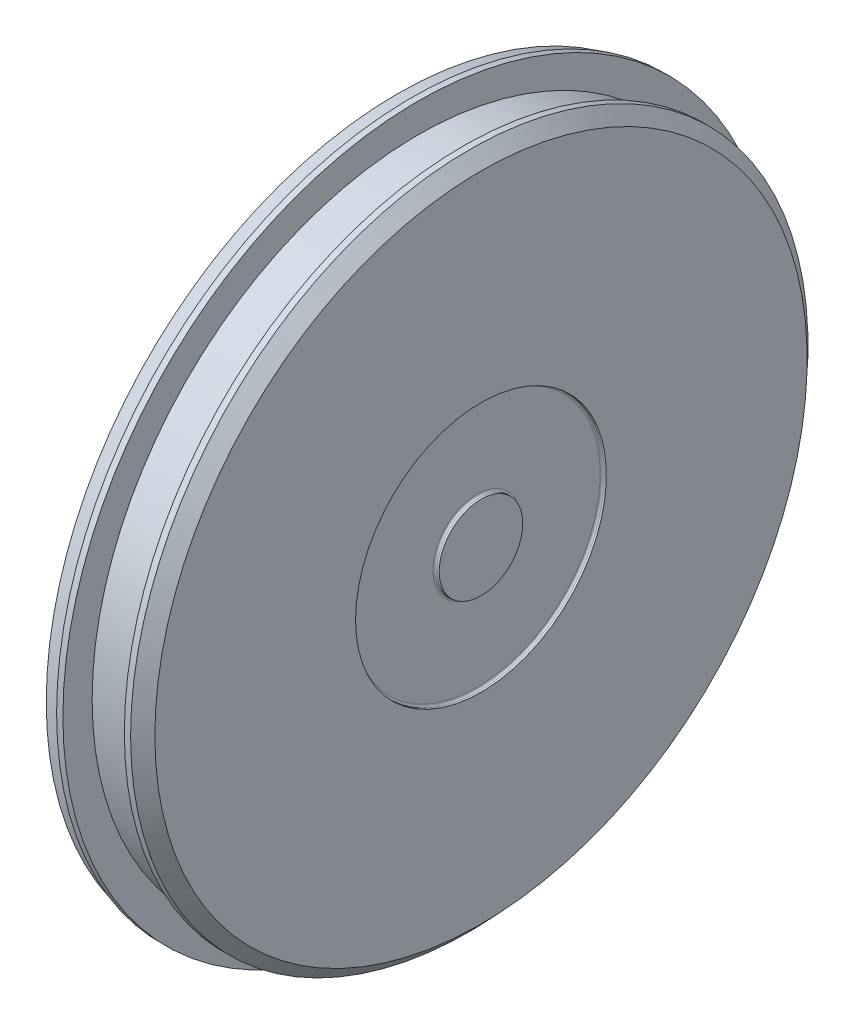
ISO-10303-21;
HEADER;
FILE_DESCRIPTION(('STEP AP214'),'2;1');
FILE_NAME('part.step','',(''),(''),'','','');
FILE_SCHEMA(('AUTOMOTIVE_DESIGN { 1 0 10303 214 1 1 1 1 }'));
ENDSEC;
DATA;
#1=APPLICATION_CONTEXT('core data for automotive mechanical design processes');
#2=APPLICATION_PROTOCOL_DEFINITION('international standard','automotive_design',2000,#1);
#3=PRODUCT_CONTEXT('',#1,'mechanical');
#4=PRODUCT('Part','Part','',(#3));
#5=PRODUCT_RELATED_PRODUCT_CATEGORY('part','',(#4));
#6=PRODUCT_DEFINITION_FORMATION('','',#4);
#7=PRODUCT_DEFINITION_CONTEXT('part definition',#1,'design');
#8=PRODUCT_DEFINITION('design','',#6,#7);
#9=PRODUCT_DEFINITION_SHAPE('','',#8);
#10=(LENGTH_UNIT() NAMED_UNIT(*) SI_UNIT(.MILLI.,.METRE.));
#11=(NAMED_UNIT(*) PLANE_ANGLE_UNIT() SI_UNIT($,.RADIAN.));
#12=(NAMED_UNIT(*) SI_UNIT($,.STERADIAN.) SOLID_ANGLE_UNIT());
#13=UNCERTAINTY_MEASURE_WITH_UNIT(LENGTH_MEASURE(1.E-05),#10,'distance_accuracy_value','');
#14=(GEOMETRIC_REPRESENTATION_CONTEXT(3) GLOBAL_UNCERTAINTY_ASSIGNED_CONTEXT((#13)) GLOBAL_UNIT_ASSIGNED_CONTEXT((#10,
#11,#12)) REPRESENTATION_CONTEXT('',''));
#15=CARTESIAN_POINT('',(0.,0.,0.));
#16=DIRECTION('',(0.,0.,1.));
#17=DIRECTION('',(1.,0.,0.));
#18=AXIS2_PLACEMENT_3D('',#15,#16,#17);
#19=CARTESIAN_POINT('',(-53.0000000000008,-2.4980018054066E-13,-1.11022302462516E-13));
#20=DIRECTION('',(-1.,0.,0.));
#21=DIRECTION('',(0.,0.,1.));
#22=AXIS2_PLACEMENT_3D('',#19,#20,#21);
#23=CONICAL_SURFACE('',#22,9.24999999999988,0.785398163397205);
#24=CARTESIAN_POINT('',(-52.7500000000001,-1.11022302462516E-13,1.11022302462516E-13));
#25=DIRECTION('',(-1.,0.,0.));
#26=DIRECTION('',(0.,0.,1.));
#27=AXIS2_PLACEMENT_3D('',#24,#25,#26);
#28=CIRCLE('',#27,9.);
#29=CARTESIAN_POINT('',(-52.7500000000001,-2.49931911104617E-13,8.99999999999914));
#30=VERTEX_POINT('',#29);
#31=EDGE_CURVE('E10',#30,#30,#28,.T.);
#32=CARTESIAN_POINT('',(-53.0000000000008,-2.4980018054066E-13,-1.11022302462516E-13));
#33=DIRECTION('',(-1.,0.,0.));
#34=DIRECTION('',(0.,0.,1.));
#35=AXIS2_PLACEMENT_3D('',#32,#33,#34);
#36=CIRCLE('',#35,9.24999999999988);
#37=CARTESIAN_POINT('',(-53.0000000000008,-2.49946602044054E-13,9.24999999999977));
#38=VERTEX_POINT('',#37);
#39=EDGE_CURVE('E223',#38,#38,#36,.T.);
#40=CARTESIAN_POINT('',(-52.7500000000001,-2.49931911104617E-13,8.99999999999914));
#41=CARTESIAN_POINT('',(-52.7526041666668,-2.49932064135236E-13,9.00260416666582));
#42=CARTESIAN_POINT('',(-52.7552083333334,-2.49932217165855E-13,9.00520833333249));
#43=CARTESIAN_POINT('',(-52.7604166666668,-2.49932523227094E-13,9.01041666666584));
#44=CARTESIAN_POINT('',(-52.7630208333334,-2.49932676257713E-13,9.01302083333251));
#45=CARTESIAN_POINT('',(-52.7682291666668,-2.49932982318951E-13,9.01822916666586));
#46=CARTESIAN_POINT('',(-52.7708333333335,-2.4993313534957E-13,9.02083333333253));
#47=CARTESIAN_POINT('',(-52.7760416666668,-2.49933441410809E-13,9.02604166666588));
#48=CARTESIAN_POINT('',(-52.7786458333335,-2.49933594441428E-13,9.02864583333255));
#49=CARTESIAN_POINT('',(-52.7838541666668,-2.49933900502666E-13,9.0338541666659));
#50=CARTESIAN_POINT('',(-52.7864583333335,-2.49934053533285E-13,9.03645833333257));
#51=CARTESIAN_POINT('',(-52.7916666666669,-2.49934359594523E-13,9.04166666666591));
#52=CARTESIAN_POINT('',(-52.7942708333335,-2.49934512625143E-13,9.04427083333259));
#53=CARTESIAN_POINT('',(-52.7994791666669,-2.49934818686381E-13,9.04947916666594));
#54=CARTESIAN_POINT('',(-52.8020833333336,-2.49934971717E-13,9.05208333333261));
#55=CARTESIAN_POINT('',(-52.8072916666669,-2.49935277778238E-13,9.05729166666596));
#56=CARTESIAN_POINT('',(-52.8098958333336,-2.49935430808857E-13,9.05989583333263));
#57=CARTESIAN_POINT('',(-52.8151041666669,-2.49935736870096E-13,9.06510416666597));
#58=CARTESIAN_POINT('',(-52.8177083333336,-2.49935889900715E-13,9.06770833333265));
#59=CARTESIAN_POINT('',(-52.822916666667,-2.49936195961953E-13,9.07291666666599));
#60=CARTESIAN_POINT('',(-52.8255208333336,-2.49936348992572E-13,9.07552083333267));
#61=CARTESIAN_POINT('',(-52.830729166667,-2.4993665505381E-13,9.08072916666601));
#62=CARTESIAN_POINT('',(-52.8333333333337,-2.4993680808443E-13,9.08333333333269));
#63=CARTESIAN_POINT('',(-52.838541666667,-2.49937114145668E-13,9.08854166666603));
#64=CARTESIAN_POINT('',(-52.8411458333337,-2.49937267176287E-13,9.09114583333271));
#65=CARTESIAN_POINT('',(-52.846354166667,-2.49937573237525E-13,9.09635416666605));
#66=CARTESIAN_POINT('',(-52.8489583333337,-2.49937726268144E-13,9.09895833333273));
#67=CARTESIAN_POINT('',(-52.8541666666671,-2.49938032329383E-13,9.10416666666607));
#68=CARTESIAN_POINT('',(-52.8567708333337,-2.49938185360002E-13,9.10677083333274));
#69=CARTESIAN_POINT('',(-52.8619791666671,-2.4993849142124E-13,9.11197916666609));
#70=CARTESIAN_POINT('',(-52.8645833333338,-2.49938644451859E-13,9.11458333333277));
#71=CARTESIAN_POINT('',(-52.8697916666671,-2.49938950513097E-13,9.11979166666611));
#72=CARTESIAN_POINT('',(-52.8723958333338,-2.49939103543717E-13,9.12239583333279));
#73=CARTESIAN_POINT('',(-52.8776041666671,-2.49939409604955E-13,9.12760416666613));
#74=CARTESIAN_POINT('',(-52.8802083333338,-2.49939562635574E-13,9.1302083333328));
#75=CARTESIAN_POINT('',(-52.8854166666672,-2.49939868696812E-13,9.13541666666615));
#76=CARTESIAN_POINT('',(-52.8880208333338,-2.49940021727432E-13,9.13802083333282));
#77=CARTESIAN_POINT('',(-52.8932291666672,-2.4994032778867E-13,9.14322916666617));
#78=CARTESIAN_POINT('',(-52.8958333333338,-2.49940480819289E-13,9.14583333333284));
#79=CARTESIAN_POINT('',(-52.9010416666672,-2.49940786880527E-13,9.15104166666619));
#80=CARTESIAN_POINT('',(-52.9036458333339,-2.49940939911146E-13,9.15364583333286));
#81=CARTESIAN_POINT('',(-52.9088541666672,-2.49941245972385E-13,9.15885416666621));
#82=CARTESIAN_POINT('',(-52.9114583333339,-2.49941399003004E-13,9.16145833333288));
#83=CARTESIAN_POINT('',(-52.9166666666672,-2.49941705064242E-13,9.16666666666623));
#84=CARTESIAN_POINT('',(-52.9192708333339,-2.49941858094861E-13,9.1692708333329));
#85=CARTESIAN_POINT('',(-52.9244791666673,-2.49942164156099E-13,9.17447916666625));
#86=CARTESIAN_POINT('',(-52.9270833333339,-2.49942317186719E-13,9.17708333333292));
#87=CARTESIAN_POINT('',(-52.9322916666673,-2.49942623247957E-13,9.18229166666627));
#88=CARTESIAN_POINT('',(-52.934895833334,-2.49942776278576E-13,9.18489583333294));
#89=CARTESIAN_POINT('',(-52.9401041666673,-2.49943082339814E-13,9.19010416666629));
#90=CARTESIAN_POINT('',(-52.942708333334,-2.49943235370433E-13,9.19270833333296));
#91=CARTESIAN_POINT('',(-52.9479166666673,-2.49943541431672E-13,9.19791666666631));
#92=CARTESIAN_POINT('',(-52.950520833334,-2.49943694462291E-13,9.20052083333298));
#93=CARTESIAN_POINT('',(-52.9557291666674,-2.49944000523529E-13,9.20572916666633));
#94=CARTESIAN_POINT('',(-52.958333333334,-2.49944153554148E-13,9.208333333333));
#95=CARTESIAN_POINT('',(-52.9635416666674,-2.49944459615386E-13,9.21354166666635));
#96=CARTESIAN_POINT('',(-52.9661458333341,-2.49944612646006E-13,9.21614583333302));
#97=CARTESIAN_POINT('',(-52.9713541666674,-2.49944918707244E-13,9.22135416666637));
#98=CARTESIAN_POINT('',(-52.9739583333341,-2.49945071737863E-13,9.22395833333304));
#99=CARTESIAN_POINT('',(-52.9791666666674,-2.49945377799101E-13,9.22916666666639));
#100=CARTESIAN_POINT('',(-52.9817708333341,-2.4994553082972E-13,9.23177083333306));
#101=CARTESIAN_POINT('',(-52.9869791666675,-2.49945836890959E-13,9.2369791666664));
#102=CARTESIAN_POINT('',(-52.9895833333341,-2.49945989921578E-13,9.23958333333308));
#103=CARTESIAN_POINT('',(-52.9947916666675,-2.49946295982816E-13,9.24479166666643));
#104=CARTESIAN_POINT('',(-52.9973958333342,-2.49946449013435E-13,9.2473958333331));
#105=CARTESIAN_POINT('',(-53.0000000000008,-2.49946602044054E-13,9.24999999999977));
#106=B_SPLINE_CURVE_WITH_KNOTS('',3,(#40,#41,#42,#43,#44,#45,#46,#47,#48,#49,#50,#51,#52,#53,
#54,#55,#56,#57,#58,#59,#60,#61,#62,#63,#64,#65,#66,#67,#68,#69,#70,#71,#72,#73,#74,#75,#76,#77,
#78,#79,#80,#81,#82,#83,#84,#85,#86,#87,#88,#89,#90,#91,#92,#93,#94,#95,#96,#97,#98,#99,#100,
#101,#102,#103,#104,#105),.UNSPECIFIED.,.F.,.F.,(4,2,2,2,2,2,2,2,2,2,2,2,2,2,2,2,2,2,2,2,2,2,2,
2,2,2,2,2,2,2,2,2,4),(0.,0.0110485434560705,0.022097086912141,0.0331456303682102,
0.0441941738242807,0.0552427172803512,0.0662912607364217,0.0773398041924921,0.0883883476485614,
0.0994368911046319,0.110485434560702,0.121533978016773,0.132582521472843,0.143631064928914,
0.154679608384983,0.165728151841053,0.176776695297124,0.187825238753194,0.198873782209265,
0.209922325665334,0.220970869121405,0.232019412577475,0.243067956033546,0.254116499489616,
0.265165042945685,0.276213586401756,0.287262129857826,0.298310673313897,0.309359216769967,
0.320407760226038,0.331456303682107,0.342504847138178,0.353553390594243),.UNSPECIFIED.);
#107=EDGE_CURVE('BSEAM34',#30,#38,#106,.T.);
#108=ORIENTED_EDGE('',*,*,#31,.F.);
#109=ORIENTED_EDGE('',*,*,#39,.T.);
#110=ORIENTED_EDGE('',*,*,#107,.T.);
#111=ORIENTED_EDGE('',*,*,#107,.F.);
#112=EDGE_LOOP('',(#108,#110,#109,#111));
#113=FACE_BOUND('',#112,.T.);
#114=ADVANCED_FACE('F34',(#113),#23,.F.);
#115=CARTESIAN_POINT('',(-110.000000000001,0.,0.));
#116=DIRECTION('',(-1.,0.,0.));
#117=DIRECTION('',(0.,0.,1.));
#118=AXIS2_PLACEMENT_3D('',#115,#116,#117);
#119=CYLINDRICAL_SURFACE('',#118,9.);
#120=CARTESIAN_POINT('',(-40.0000000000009,0.,9.00000000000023));
#121=CARTESIAN_POINT('',(-40.0000008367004,0.10654356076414,8.99999931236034));
#122=CARTESIAN_POINT('',(-40.0042626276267,0.213114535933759,8.99810295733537));
#123=CARTESIAN_POINT('',(-40.0212664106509,0.425487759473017,8.99056534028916));
#124=CARTESIAN_POINT('',(-40.0340132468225,0.531289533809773,8.98492193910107));
#125=CARTESIAN_POINT('',(-40.0678848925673,0.741497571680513,8.97002203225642));
#126=CARTESIAN_POINT('',(-40.0890253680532,0.845900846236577,8.96075877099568));
#127=CARTESIAN_POINT('',(-40.1394527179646,1.05237393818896,8.93886560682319));
#128=CARTESIAN_POINT('',(-40.1687429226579,1.15444278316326,8.92623432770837));
#129=CARTESIAN_POINT('',(-40.268173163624,1.45528706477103,8.88385509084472));
#130=CARTESIAN_POINT('',(-40.350035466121,1.64969223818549,8.8495469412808));
#131=CARTESIAN_POINT('',(-40.5421573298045,2.02169397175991,8.77205693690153));
#132=CARTESIAN_POINT('',(-40.6524104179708,2.19929435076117,8.72887710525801));
#133=CARTESIAN_POINT('',(-40.9046704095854,2.5429519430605,8.63520005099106));
#134=CARTESIAN_POINT('',(-41.0480057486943,2.70796463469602,8.58444255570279));
#135=CARTESIAN_POINT('',(-41.3594860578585,3.01251193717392,8.48237167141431));
#136=CARTESIAN_POINT('',(-41.5276457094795,3.15203136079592,8.43105797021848));
#137=CARTESIAN_POINT('',(-41.89592097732,3.40970641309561,8.33031613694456));
#138=CARTESIAN_POINT('',(-42.0973210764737,3.52616342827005,8.28116793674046));
#139=CARTESIAN_POINT('',(-42.4135583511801,3.67379855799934,8.21620901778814));
#140=CARTESIAN_POINT('',(-42.5213695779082,3.71851343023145,8.19601074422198));
#141=CARTESIAN_POINT('',(-42.7410191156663,3.79849956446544,8.15924882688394));
#142=CARTESIAN_POINT('',(-42.8528552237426,3.83377590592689,8.14268322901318));
#143=CARTESIAN_POINT('',(-43.0737900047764,3.89288163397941,8.11458487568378));
#144=CARTESIAN_POINT('',(-43.1827274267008,3.91721191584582,8.10283476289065));
#145=CARTESIAN_POINT('',(-43.402578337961,3.95670961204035,8.08362129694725));
#146=CARTESIAN_POINT('',(-43.5134908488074,3.97188144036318,8.07615587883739));
#147=CARTESIAN_POINT('',(-43.7363722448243,3.99287182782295,8.06579894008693));
#148=CARTESIAN_POINT('',(-43.8483407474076,3.99869365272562,8.06290582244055));
#149=CARTESIAN_POINT('',(-44.0723891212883,4.00091360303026,8.06180452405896));
#150=CARTESIAN_POINT('',(-44.1844689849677,3.99731233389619,8.06359604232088));
#151=CARTESIAN_POINT('',(-44.3977271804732,3.98148137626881,8.07142338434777));
#152=CARTESIAN_POINT('',(-44.4989804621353,3.970055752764,8.07706352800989));
#153=CARTESIAN_POINT('',(-44.7000710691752,3.93957606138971,8.09197245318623));
#154=CARTESIAN_POINT('',(-44.7999079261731,3.92051952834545,8.10124240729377));
#155=CARTESIAN_POINT('',(-45.0962376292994,3.85217674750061,8.13408651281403));
#156=CARTESIAN_POINT('',(-45.2897178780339,3.79170447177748,8.16270181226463));
#157=CARTESIAN_POINT('',(-45.6678984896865,3.64150006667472,8.23081734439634));
#158=CARTESIAN_POINT('',(-45.8523042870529,3.55114161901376,8.27054749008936));
#159=CARTESIAN_POINT('',(-46.2041434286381,3.34416344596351,8.35638151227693));
#160=CARTESIAN_POINT('',(-46.3715695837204,3.22753266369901,8.40248806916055));
#161=CARTESIAN_POINT('',(-46.7018297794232,2.95801583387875,8.50133279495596));
#162=CARTESIAN_POINT('',(-46.86262764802,2.80270476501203,8.55427944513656));
#163=CARTESIAN_POINT('',(-47.1566341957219,2.46687651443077,8.65709798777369));
#164=CARTESIAN_POINT('',(-47.2898345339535,2.28635173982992,8.70696894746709));
#165=CARTESIAN_POINT('',(-47.528426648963,1.89830549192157,8.79984898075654));
#166=CARTESIAN_POINT('',(-47.6328807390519,1.69014406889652,8.84261183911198));
#167=CARTESIAN_POINT('',(-47.8045538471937,1.2568148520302,8.91451161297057));
#168=CARTESIAN_POINT('',(-47.8717963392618,1.03165788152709,8.9436571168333));
#169=CARTESIAN_POINT('',(-47.9626237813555,0.587641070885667,8.98336516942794));
#170=CARTESIAN_POINT('',(-47.9889334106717,0.369442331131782,8.99508492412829));
#171=CARTESIAN_POINT('',(-48.0054062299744,-0.0685540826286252,9.00240007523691));
#172=CARTESIAN_POINT('',(-47.9955816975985,-0.288351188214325,8.99800094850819));
#173=CARTESIAN_POINT('',(-47.9419129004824,-0.709814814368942,8.97430591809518));
#174=CARTESIAN_POINT('',(-47.9000783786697,-0.911792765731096,8.95589038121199));
#175=CARTESIAN_POINT('',(-47.7864838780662,-1.30558421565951,8.90701082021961));
#176=CARTESIAN_POINT('',(-47.7147202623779,-1.49739647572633,8.87654533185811));
#177=CARTESIAN_POINT('',(-47.5410228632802,-1.87220783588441,8.80524764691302));
#178=CARTESIAN_POINT('',(-47.4382176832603,-2.0547452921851,8.76412168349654));
#179=CARTESIAN_POINT('',(-47.2062947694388,-2.40063957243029,8.67576208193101));
#180=CARTESIAN_POINT('',(-47.0771655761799,-2.56398799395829,8.62852578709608));
#181=CARTESIAN_POINT('',(-46.7841760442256,-2.88073032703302,8.52825739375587));
#182=CARTESIAN_POINT('',(-46.618355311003,-3.03226090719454,8.47506500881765));
#183=CARTESIAN_POINT('',(-46.2628521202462,-3.30602071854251,8.37207677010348));
#184=CARTESIAN_POINT('',(-46.073161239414,-3.42823956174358,8.32228212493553));
#185=CARTESIAN_POINT('',(-45.771754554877,-3.5880743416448,8.25404075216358));
#186=CARTESIAN_POINT('',(-45.6671202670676,-3.6378838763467,8.23214803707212));
#187=CARTESIAN_POINT('',(-45.4534110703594,-3.72840991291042,8.19154569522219));
#188=CARTESIAN_POINT('',(-45.3443381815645,-3.76913049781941,8.17283464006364));
#189=CARTESIAN_POINT('',(-45.1225782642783,-3.84101557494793,8.13929816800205));
#190=CARTESIAN_POINT('',(-45.0098933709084,-3.87218560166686,8.12447050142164));
#191=CARTESIAN_POINT('',(-44.7817509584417,-3.9246092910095,8.09927719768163));
#192=CARTESIAN_POINT('',(-44.6662937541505,-3.9458640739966,8.08891105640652));
#193=CARTESIAN_POINT('',(-44.4435206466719,-3.97678770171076,8.07374935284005));
#194=CARTESIAN_POINT('',(-44.3363465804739,-3.98728755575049,8.06855529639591));
#195=CARTESIAN_POINT('',(-44.1213401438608,-3.99960939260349,8.06245450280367));
#196=CARTESIAN_POINT('',(-44.013507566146,-4.00142848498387,8.06154919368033));
#197=CARTESIAN_POINT('',(-43.7981559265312,-3.99635429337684,8.06406616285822));
#198=CARTESIAN_POINT('',(-43.6906367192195,-3.98946605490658,8.06748593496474));
#199=CARTESIAN_POINT('',(-43.4767023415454,-3.96708318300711,8.07851431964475));
#200=CARTESIAN_POINT('',(-43.3702876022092,-3.95158530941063,8.08612450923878));
#201=CARTESIAN_POINT('',(-43.0667466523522,-3.89481025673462,8.11370655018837));
#202=CARTESIAN_POINT('',(-42.8719560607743,-3.84284512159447,8.13866591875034));
#203=CARTESIAN_POINT('',(-42.4940010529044,-3.71108221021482,8.19957700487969));
#204=CARTESIAN_POINT('',(-42.3108400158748,-3.63127638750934,8.23553189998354));
#205=CARTESIAN_POINT('',(-41.9483352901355,-3.4402432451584,8.31722161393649));
#206=CARTESIAN_POINT('',(-41.7699883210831,-3.32733013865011,8.3634354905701));
#207=CARTESIAN_POINT('',(-41.4337467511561,-3.07546946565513,8.45929191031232));
#208=CARTESIAN_POINT('',(-41.2758607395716,-2.93651102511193,8.50893588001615));
#209=CARTESIAN_POINT('',(-40.9707594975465,-2.62217220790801,8.61126362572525));
#210=CARTESIAN_POINT('',(-40.8256858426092,-2.44466910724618,8.66383343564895));
#211=CARTESIAN_POINT('',(-40.5671157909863,-2.06586629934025,8.76186799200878));
#212=CARTESIAN_POINT('',(-40.4536338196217,-1.86455578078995,8.80732948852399));
#213=CARTESIAN_POINT('',(-40.3107804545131,-1.55009155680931,8.86614466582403));
#214=CARTESIAN_POINT('',(-40.2678748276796,-1.44376115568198,8.88411858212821));
#215=CARTESIAN_POINT('',(-40.1912260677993,-1.22735110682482,8.91658812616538));
#216=CARTESIAN_POINT('',(-40.1574785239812,-1.11727329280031,8.93108542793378));
#217=CARTESIAN_POINT('',(-40.09959768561,-0.894475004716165,8.9561409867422));
#218=CARTESIAN_POINT('',(-40.075441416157,-0.781761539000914,8.96670865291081));
#219=CARTESIAN_POINT('',(-40.0369332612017,-0.554414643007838,8.9836293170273));
#220=CARTESIAN_POINT('',(-40.0225745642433,-0.439782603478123,8.98998524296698));
#221=CARTESIAN_POINT('',(-40.0088038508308,-0.270722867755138,8.99608997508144));
#222=CARTESIAN_POINT('',(-40.0055037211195,-0.21664466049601,8.99755504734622));
#223=CARTESIAN_POINT('',(-40.0011015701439,-0.108380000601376,8.9995102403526));
#224=CARTESIAN_POINT('',(-39.9999995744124,-0.0541935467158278,9.00000034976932));
#225=CARTESIAN_POINT('',(-40.0000000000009,0.,9.00000000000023));
#226=B_SPLINE_CURVE_WITH_KNOTS('',3,(#120,#121,#122,#123,#124,#125,#126,#127,#128,#129,#130,
#131,#132,#133,#134,#135,#136,#137,#138,#139,#140,#141,#142,#143,#144,#145,#146,#147,#148,#149,
#150,#151,#152,#153,#154,#155,#156,#157,#158,#159,#160,#161,#162,#163,#164,#165,#166,#167,#168,
#169,#170,#171,#172,#173,#174,#175,#176,#177,#178,#179,#180,#181,#182,#183,#184,#185,#186,#187,
#188,#189,#190,#191,#192,#193,#194,#195,#196,#197,#198,#199,#200,#201,#202,#203,#204,#205,#206,
#207,#208,#209,#210,#211,#212,#213,#214,#215,#216,#217,#218,#219,#220,#221,#222,#223,#224,#225),
.UNSPECIFIED.,.T.,.F.,(4,2,2,2,2,2,2,2,2,2,2,2,2,2,2,2,2,2,2,2,2,2,2,2,2,2,2,2,2,2,2,2,2,2,2,2,
2,2,2,2,2,2,2,2,2,2,2,2,2,2,2,2,4),(0.,0.319575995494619,0.639334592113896,0.959692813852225,
1.28018213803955,1.91817504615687,2.55602262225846,3.22626867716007,3.89691272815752,
4.60627839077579,4.96122462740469,5.31597945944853,5.65223953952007,5.98833742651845,
6.32431789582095,6.66027677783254,6.96605959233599,7.27194127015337,7.8832042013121,
8.50818797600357,9.13343527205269,9.81959120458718,10.5059542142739,11.2125921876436,
11.9187838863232,12.5755805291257,13.2321540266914,13.8505799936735,14.4690811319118,
15.1068781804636,15.7449534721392,16.4344546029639,17.1241997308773,17.4776093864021,
17.8308599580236,18.1839054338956,18.536911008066,18.8599212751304,19.1830390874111,
19.5059697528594,19.8290220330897,20.4355356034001,21.0422246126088,21.6877902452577,
22.3336260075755,23.0359566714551,23.7386075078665,24.0863996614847,24.4340240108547,
24.7808105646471,25.1273557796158,25.2899067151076,25.4524595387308),.UNSPECIFIED.);
#227=CARTESIAN_POINT('',(-40.0000000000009,0.,9.00000000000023));
#228=VERTEX_POINT('',#227);
#229=EDGE_CURVE('E77',#228,#228,#226,.T.);
#230=ORIENTED_EDGE('',*,*,#229,.T.);
#231=EDGE_LOOP('',(#230));
#232=FACE_BOUND('',#231,.T.);
#233=CARTESIAN_POINT('',(-40.0000000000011,0.,-8.99999999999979));
#234=CARTESIAN_POINT('',(-40.0000008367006,-0.106543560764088,-8.99999931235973));
#235=CARTESIAN_POINT('',(-40.0042626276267,-0.213114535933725,-8.9981029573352));
#236=CARTESIAN_POINT('',(-40.0212664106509,-0.425487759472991,-8.99056534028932));
#237=CARTESIAN_POINT('',(-40.0340132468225,-0.531289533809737,-8.98492193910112));
#238=CARTESIAN_POINT('',(-40.0678848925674,-0.74149757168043,-8.97002203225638));
#239=CARTESIAN_POINT('',(-40.0890253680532,-0.845900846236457,-8.96075877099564));
#240=CARTESIAN_POINT('',(-40.1394527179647,-1.05237393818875,-8.93886560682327));
#241=CARTESIAN_POINT('',(-40.1687429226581,-1.15444278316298,-8.92623432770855));
#242=CARTESIAN_POINT('',(-40.2681731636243,-1.45528706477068,-8.883855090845));
#243=CARTESIAN_POINT('',(-40.3500354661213,-1.6496922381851,-8.84954694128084));
#244=CARTESIAN_POINT('',(-40.5421573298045,-2.02169397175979,-8.77205693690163));
#245=CARTESIAN_POINT('',(-40.6524104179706,-2.19929435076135,-8.72887710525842));
#246=CARTESIAN_POINT('',(-40.9046704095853,-2.54295194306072,-8.63520005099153));
#247=CARTESIAN_POINT('',(-41.0480057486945,-2.70796463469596,-8.58444255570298));
#248=CARTESIAN_POINT('',(-41.359486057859,-3.01251193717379,-8.48237167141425));
#249=CARTESIAN_POINT('',(-41.5276457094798,-3.15203136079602,-8.43105797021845));
#250=CARTESIAN_POINT('',(-41.8959209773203,-3.40970641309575,-8.33031613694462));
#251=CARTESIAN_POINT('',(-42.0973210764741,-3.52616342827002,-8.28116793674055));
#252=CARTESIAN_POINT('',(-42.4135583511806,-3.673798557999,-8.21620901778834));
#253=CARTESIAN_POINT('',(-42.5213695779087,-3.718513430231,-8.19601074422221));
#254=CARTESIAN_POINT('',(-42.7410191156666,-3.79849956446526,-8.15924882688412));
#255=CARTESIAN_POINT('',(-42.8528552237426,-3.8337759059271,-8.14268322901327));
#256=CARTESIAN_POINT('',(-43.0737900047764,-3.89288163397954,-8.11458487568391));
#257=CARTESIAN_POINT('',(-43.1827274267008,-3.91721191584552,-8.1028347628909));
#258=CARTESIAN_POINT('',(-43.4025783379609,-3.95670961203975,-8.08362129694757));
#259=CARTESIAN_POINT('',(-43.5134908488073,-3.97188144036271,-8.07615587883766));
#260=CARTESIAN_POINT('',(-43.7363722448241,-3.99287182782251,-8.06579894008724));
#261=CARTESIAN_POINT('',(-43.8483407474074,-3.99869365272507,-8.06290582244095));
#262=CARTESIAN_POINT('',(-44.0723891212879,-4.00091360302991,-8.06180452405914));
#263=CARTESIAN_POINT('',(-44.1844689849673,-3.99731233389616,-8.06359604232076));
#264=CARTESIAN_POINT('',(-44.3977271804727,-3.98148137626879,-8.07142338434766));
#265=CARTESIAN_POINT('',(-44.4989804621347,-3.97005575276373,-8.07706352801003));
#266=CARTESIAN_POINT('',(-44.7000710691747,-3.93957606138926,-8.09197245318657));
#267=CARTESIAN_POINT('',(-44.7999079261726,-3.92051952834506,-8.10124240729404));
#268=CARTESIAN_POINT('',(-45.0962376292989,-3.85217674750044,-8.13408651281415));
#269=CARTESIAN_POINT('',(-45.2897178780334,-3.79170447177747,-8.16270181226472));
#270=CARTESIAN_POINT('',(-45.6678984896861,-3.64150006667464,-8.2308173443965));
#271=CARTESIAN_POINT('',(-45.8523042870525,-3.55114161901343,-8.27054749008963));
#272=CARTESIAN_POINT('',(-46.2041434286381,-3.34416344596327,-8.35638151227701));
#273=CARTESIAN_POINT('',(-46.3715695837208,-3.22753266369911,-8.40248806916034));
#274=CARTESIAN_POINT('',(-46.7018297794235,-2.95801583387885,-8.5013327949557));
#275=CARTESIAN_POINT('',(-46.8626276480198,-2.80270476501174,-8.55427944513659));
#276=CARTESIAN_POINT('',(-47.1566341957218,-2.46687651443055,-8.65709798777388));
#277=CARTESIAN_POINT('',(-47.289834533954,-2.28635173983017,-8.70696894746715));
#278=CARTESIAN_POINT('',(-47.5284266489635,-1.898305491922,-8.7998489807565));
#279=CARTESIAN_POINT('',(-47.6328807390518,-1.69014406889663,-8.84261183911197));
#280=CARTESIAN_POINT('',(-47.8045538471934,-1.25681485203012,-8.9145116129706));
#281=CARTESIAN_POINT('',(-47.871796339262,-1.03165788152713,-8.94365711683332));
#282=CARTESIAN_POINT('',(-47.9626237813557,-0.587641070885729,-8.98336516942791));
#283=CARTESIAN_POINT('',(-47.9889334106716,-0.369442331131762,-8.99508492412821));
#284=CARTESIAN_POINT('',(-48.0054062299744,0.0685540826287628,-9.00240007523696));
#285=CARTESIAN_POINT('',(-47.9955816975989,0.288351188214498,-8.99800094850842));
#286=CARTESIAN_POINT('',(-47.9419129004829,0.709814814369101,-8.9743059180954));
#287=CARTESIAN_POINT('',(-47.9000783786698,0.911792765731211,-8.95589038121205));
#288=CARTESIAN_POINT('',(-47.7864838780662,1.30558421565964,-8.90701082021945));
#289=CARTESIAN_POINT('',(-47.7147202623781,1.49739647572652,-8.8765453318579));
#290=CARTESIAN_POINT('',(-47.5410228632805,1.87220783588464,-8.80524764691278));
#291=CARTESIAN_POINT('',(-47.4382176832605,2.05474529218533,-8.76412168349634));
#292=CARTESIAN_POINT('',(-47.2062947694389,2.40063957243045,-8.675762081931));
#293=CARTESIAN_POINT('',(-47.0771655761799,2.56398799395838,-8.62852578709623));
#294=CARTESIAN_POINT('',(-46.7841760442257,2.88073032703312,-8.52825739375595));
#295=CARTESIAN_POINT('',(-46.6183553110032,3.03226090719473,-8.47506500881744));
#296=CARTESIAN_POINT('',(-46.2628521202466,3.30602071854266,-8.37207677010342));
#297=CARTESIAN_POINT('',(-46.0731612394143,3.4282395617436,-8.32228212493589));
#298=CARTESIAN_POINT('',(-45.7717545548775,3.5880743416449,-8.25404075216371));
#299=CARTESIAN_POINT('',(-45.6671202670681,3.6378838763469,-8.23214803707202));
#300=CARTESIAN_POINT('',(-45.4534110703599,3.72840991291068,-8.19154569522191));
#301=CARTESIAN_POINT('',(-45.344338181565,3.76913049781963,-8.17283464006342));
#302=CARTESIAN_POINT('',(-45.1225782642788,3.8410155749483,-8.13929816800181));
#303=CARTESIAN_POINT('',(-45.0098933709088,3.87218560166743,-8.12447050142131));
#304=CARTESIAN_POINT('',(-44.781750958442,3.92460929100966,-8.09927719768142));
#305=CARTESIAN_POINT('',(-44.6662937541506,3.94586407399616,-8.08891105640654));
#306=CARTESIAN_POINT('',(-44.4435206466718,3.97678770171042,-8.07374935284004));
#307=CARTESIAN_POINT('',(-44.3363465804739,3.98728755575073,-8.06855529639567));
#308=CARTESIAN_POINT('',(-44.1213401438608,3.99960939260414,-8.06245450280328));
#309=CARTESIAN_POINT('',(-44.0135075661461,4.00142848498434,-8.06154919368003));
#310=CARTESIAN_POINT('',(-43.7981559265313,3.99635429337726,-8.06406616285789));
#311=CARTESIAN_POINT('',(-43.6906367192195,3.98946605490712,-8.06748593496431));
#312=CARTESIAN_POINT('',(-43.4767023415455,3.96708318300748,-8.07851431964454));
#313=CARTESIAN_POINT('',(-43.3702876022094,3.95158530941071,-8.08612450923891));
#314=CARTESIAN_POINT('',(-43.0667466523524,3.89481025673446,-8.11370655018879));
#315=CARTESIAN_POINT('',(-42.8719560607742,3.84284512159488,-8.13866591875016));
#316=CARTESIAN_POINT('',(-42.4940010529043,3.71108221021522,-8.19957700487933));
#317=CARTESIAN_POINT('',(-42.3108400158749,3.63127638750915,-8.23553189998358));
#318=CARTESIAN_POINT('',(-41.9483352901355,3.44024324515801,-8.31722161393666));
#319=CARTESIAN_POINT('',(-41.7699883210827,3.32733013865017,-8.36343549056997));
#320=CARTESIAN_POINT('',(-41.4337467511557,3.0754694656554,-8.45929191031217));
#321=CARTESIAN_POINT('',(-41.2758607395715,2.93651102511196,-8.50893588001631));
#322=CARTESIAN_POINT('',(-40.9707594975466,2.62217220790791,-8.61126362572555));
#323=CARTESIAN_POINT('',(-40.8256858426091,2.44466910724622,-8.66383343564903));
#324=CARTESIAN_POINT('',(-40.5671157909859,2.06586629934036,-8.76186799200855));
#325=CARTESIAN_POINT('',(-40.4536338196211,1.86455578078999,-8.80732948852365));
#326=CARTESIAN_POINT('',(-40.3107804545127,1.55009155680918,-8.86614466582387));
#327=CARTESIAN_POINT('',(-40.2678748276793,1.4437611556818,-8.88411858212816));
#328=CARTESIAN_POINT('',(-40.1912260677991,1.22735110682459,-8.91658812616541));
#329=CARTESIAN_POINT('',(-40.1574785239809,1.11727329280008,-8.93108542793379));
#330=CARTESIAN_POINT('',(-40.0995976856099,0.894475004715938,-8.95614098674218));
#331=CARTESIAN_POINT('',(-40.0754414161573,0.781761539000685,-8.9667086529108));
#332=CARTESIAN_POINT('',(-40.0369332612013,0.554414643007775,-8.98362931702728));
#333=CARTESIAN_POINT('',(-40.022574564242,0.439782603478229,-8.98998524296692));
#334=CARTESIAN_POINT('',(-40.0088038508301,0.270722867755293,-8.99608997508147));
#335=CARTESIAN_POINT('',(-40.0055037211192,0.216644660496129,-8.9975550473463));
#336=CARTESIAN_POINT('',(-40.0011015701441,0.108380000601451,-8.99951024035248));
#337=CARTESIAN_POINT('',(-39.9999995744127,0.0541935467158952,-9.00000034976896));
#338=CARTESIAN_POINT('',(-40.0000000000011,0.,-8.99999999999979));
#339=B_SPLINE_CURVE_WITH_KNOTS('',3,(#233,#234,#235,#236,#237,#238,#239,#240,#241,#242,#243,
#244,#245,#246,#247,#248,#249,#250,#251,#252,#253,#254,#255,#256,#257,#258,#259,#260,#261,#262,
#263,#264,#265,#266,#267,#268,#269,#270,#271,#272,#273,#274,#275,#276,#277,#278,#279,#280,#281,
#282,#283,#284,#285,#286,#287,#288,#289,#290,#291,#292,#293,#294,#295,#296,#297,#298,#299,#300,
#301,#302,#303,#304,#305,#306,#307,#308,#309,#310,#311,#312,#313,#314,#315,#316,#317,#318,#319,
#320,#321,#322,#323,#324,#325,#326,#327,#328,#329,#330,#331,#332,#333,#334,#335,#336,#337,#338),
.UNSPECIFIED.,.T.,.F.,(4,2,2,2,2,2,2,2,2,2,2,2,2,2,2,2,2,2,2,2,2,2,2,2,2,2,2,2,2,2,2,2,2,2,2,2,
2,2,2,2,2,2,2,2,2,2,2,2,2,2,2,2,4),(0.,0.319575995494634,0.639334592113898,0.959692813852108,
1.28018213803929,1.91817504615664,2.55602262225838,3.22626867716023,3.89691272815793,
4.60627839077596,4.96122462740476,5.3159794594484,5.65223953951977,5.98833742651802,
6.32431789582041,6.66027677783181,6.9660595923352,7.27194127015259,7.88320420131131,
8.50818797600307,9.13343527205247,9.81959120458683,10.5059542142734,11.2125921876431,
11.9187838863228,12.5755805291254,13.2321540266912,13.8505799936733,14.4690811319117,
15.1068781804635,15.744953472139,16.4344546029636,17.1241997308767,17.4776093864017,
17.8308599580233,18.1839054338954,18.5369110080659,18.8599212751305,19.1830390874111,
19.5059697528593,19.8290220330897,20.4355356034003,21.0422246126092,21.6877902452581,
22.3336260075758,23.0359566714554,23.738607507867,24.0863996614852,24.4340240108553,
24.7808105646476,25.1273557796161,25.2899067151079,25.4524595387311),.UNSPECIFIED.);
#340=CARTESIAN_POINT('',(-40.0000000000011,0.,-8.99999999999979));
#341=VERTEX_POINT('',#340);
#342=EDGE_CURVE('E73',#341,#341,#339,.T.);
#343=ORIENTED_EDGE('',*,*,#342,.T.);
#344=EDGE_LOOP('',(#343));
#345=FACE_BOUND('',#344,.T.);
#346=CARTESIAN_POINT('',(-26.0000000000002,1.38777878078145E-13,2.22044604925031E-13));
#347=DIRECTION('',(-1.,0.,0.));
#348=DIRECTION('',(0.,0.,1.));
#349=AXIS2_PLACEMENT_3D('',#346,#347,#348);
#350=CIRCLE('',#349,9.);
#351=CARTESIAN_POINT('',(-26.0000000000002,1.3863541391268E-13,9.00000000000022));
#352=VERTEX_POINT('',#351);
#353=EDGE_CURVE('E45',#352,#352,#350,.T.);
#354=ORIENTED_EDGE('',*,*,#353,.F.);
#355=EDGE_LOOP('',(#354));
#356=FACE_BOUND('',#355,.T.);
#357=ORIENTED_EDGE('',*,*,#31,.T.);
#358=EDGE_LOOP('',(#357));
#359=FACE_BOUND('',#358,.T.);
#360=ADVANCED_FACE('F81',(#232,#345,#356,#359),#119,.F.);
#361=CARTESIAN_POINT('',(-26.0000000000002,1.38777878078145E-13,2.22044604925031E-13));
#362=DIRECTION('',(-1.,0.,0.));
#363=DIRECTION('',(0.,0.,1.));
#364=AXIS2_PLACEMENT_3D('',#361,#362,#363);
#365=TOROIDAL_SURFACE('',#364,8.,1.);
#366=CARTESIAN_POINT('',(-25.0000000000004,0.,0.));
#367=DIRECTION('',(-1.,0.,0.));
#368=DIRECTION('',(0.,0.,1.));
#369=AXIS2_PLACEMENT_3D('',#366,#367,#368);
#370=CIRCLE('',#369,7.99999999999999);
#371=CARTESIAN_POINT('',(-25.0000000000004,0.,7.99999999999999));
#372=VERTEX_POINT('',#371);
#373=EDGE_CURVE('E50',#372,#372,#370,.T.);
#374=ORIENTED_EDGE('',*,*,#373,.F.);
#375=EDGE_LOOP('',(#374));
#376=FACE_BOUND('',#375,.T.);
#377=ORIENTED_EDGE('',*,*,#353,.T.);
#378=EDGE_LOOP('',(#377));
#379=FACE_BOUND('',#378,.T.);
#380=ADVANCED_FACE('F85',(#376,#379),#365,.F.);
#381=CARTESIAN_POINT('',(-25.0000000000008,8.00000000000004,1.11022302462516E-13));
#382=DIRECTION('',(1.,0.,0.));
#383=DIRECTION('',(0.,0.,-1.));
#384=AXIS2_PLACEMENT_3D('',#381,#382,#383);
#385=PLANE('',#384);
#386=ORIENTED_EDGE('',*,*,#373,.T.);
#387=EDGE_LOOP('',(#386));
#388=FACE_BOUND('',#387,.T.);
#389=ADVANCED_FACE('F90',(#388),#385,.F.);
#390=CARTESIAN_POINT('',(-19.0000000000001,9.99999999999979,-1.11022302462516E-13));
#391=DIRECTION('',(-1.,0.,0.));
#392=DIRECTION('',(0.,0.,1.));
#393=AXIS2_PLACEMENT_3D('',#390,#391,#392);
#394=PLANE('',#393);
#395=CARTESIAN_POINT('',(-19.0000000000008,-1.38777878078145E-13,1.11022302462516E-13));
#396=DIRECTION('',(-1.,0.,0.));
#397=DIRECTION('',(0.,0.,1.));
#398=AXIS2_PLACEMENT_3D('',#395,#396,#397);
#399=CIRCLE('',#398,10.);
#400=CARTESIAN_POINT('',(-19.0000000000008,0.,9.99999999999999));
#401=VERTEX_POINT('',#400);
#402=EDGE_CURVE('E317',#401,#401,#399,.T.);
#403=ORIENTED_EDGE('',*,*,#402,.F.);
#404=EDGE_LOOP('',(#403));
#405=FACE_BOUND('',#404,.T.);
#406=ADVANCED_FACE('F94',(#405),#394,.F.);
#407=CARTESIAN_POINT('',(-110.000000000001,0.,0.));
#408=DIRECTION('',(-1.,0.,0.));
#409=DIRECTION('',(0.,0.,1.));
#410=AXIS2_PLACEMENT_3D('',#407,#408,#409);
#411=CYLINDRICAL_SURFACE('',#410,9.99999999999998);
#412=CARTESIAN_POINT('',(-19.5000000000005,0.,2.22044604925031E-13));
#413=DIRECTION('',(-1.,0.,0.));
#414=DIRECTION('',(0.,0.,1.));
#415=AXIS2_PLACEMENT_3D('',#412,#413,#414);
#416=CIRCLE('',#415,9.99999999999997);
#417=CARTESIAN_POINT('',(-19.5000000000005,0.,9.99999999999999));
#418=VERTEX_POINT('',#417);
#419=EDGE_CURVE('E314',#418,#418,#416,.T.);
#420=CARTESIAN_POINT('',(-19.5000000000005,0.,9.99999999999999));
#421=CARTESIAN_POINT('',(-19.4947916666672,0.,9.99999999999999));
#422=CARTESIAN_POINT('',(-19.4895833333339,0.,9.99999999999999));
#423=CARTESIAN_POINT('',(-19.4791666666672,0.,9.99999999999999));
#424=CARTESIAN_POINT('',(-19.4739583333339,0.,9.99999999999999));
#425=CARTESIAN_POINT('',(-19.4635416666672,0.,9.99999999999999));
#426=CARTESIAN_POINT('',(-19.4583333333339,0.,9.99999999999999));
#427=CARTESIAN_POINT('',(-19.4479166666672,0.,9.99999999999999));
#428=CARTESIAN_POINT('',(-19.4427083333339,0.,9.99999999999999));
#429=CARTESIAN_POINT('',(-19.4322916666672,0.,9.99999999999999));
#430=CARTESIAN_POINT('',(-19.4270833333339,0.,9.99999999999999));
#431=CARTESIAN_POINT('',(-19.4166666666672,0.,9.99999999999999));
#432=CARTESIAN_POINT('',(-19.4114583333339,0.,9.99999999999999));
#433=CARTESIAN_POINT('',(-19.4010416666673,0.,9.99999999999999));
#434=CARTESIAN_POINT('',(-19.3958333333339,0.,9.99999999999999));
#435=CARTESIAN_POINT('',(-19.3854166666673,0.,9.99999999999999));
#436=CARTESIAN_POINT('',(-19.3802083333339,0.,9.99999999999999));
#437=CARTESIAN_POINT('',(-19.3697916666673,0.,9.99999999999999));
#438=CARTESIAN_POINT('',(-19.3645833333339,0.,9.99999999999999));
#439=CARTESIAN_POINT('',(-19.3541666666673,0.,9.99999999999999));
#440=CARTESIAN_POINT('',(-19.3489583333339,0.,9.99999999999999));
#441=CARTESIAN_POINT('',(-19.3385416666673,0.,9.99999999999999));
#442=CARTESIAN_POINT('',(-19.333333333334,0.,9.99999999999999));
#443=CARTESIAN_POINT('',(-19.3229166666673,0.,9.99999999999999));
#444=CARTESIAN_POINT('',(-19.317708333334,0.,9.99999999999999));
#445=CARTESIAN_POINT('',(-19.3072916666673,0.,9.99999999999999));
#446=CARTESIAN_POINT('',(-19.302083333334,0.,9.99999999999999));
#447=CARTESIAN_POINT('',(-19.2916666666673,0.,9.99999999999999));
#448=CARTESIAN_POINT('',(-19.286458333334,0.,9.99999999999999));
#449=CARTESIAN_POINT('',(-19.2760416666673,0.,9.99999999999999));
#450=CARTESIAN_POINT('',(-19.270833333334,0.,9.99999999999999));
#451=CARTESIAN_POINT('',(-19.2604166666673,0.,9.99999999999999));
#452=CARTESIAN_POINT('',(-19.255208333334,0.,9.99999999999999));
#453=CARTESIAN_POINT('',(-19.2447916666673,0.,9.99999999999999));
#454=CARTESIAN_POINT('',(-19.239583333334,0.,9.99999999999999));
#455=CARTESIAN_POINT('',(-19.2291666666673,0.,9.99999999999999));
#456=CARTESIAN_POINT('',(-19.223958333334,0.,9.99999999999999));
#457=CARTESIAN_POINT('',(-19.2135416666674,0.,9.99999999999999));
#458=CARTESIAN_POINT('',(-19.208333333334,0.,9.99999999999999));
#459=CARTESIAN_POINT('',(-19.1979166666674,0.,9.99999999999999));
#460=CARTESIAN_POINT('',(-19.192708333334,0.,9.99999999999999));
#461=CARTESIAN_POINT('',(-19.1822916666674,0.,9.99999999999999));
#462=CARTESIAN_POINT('',(-19.177083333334,0.,9.99999999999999));
#463=CARTESIAN_POINT('',(-19.1666666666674,0.,9.99999999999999));
#464=CARTESIAN_POINT('',(-19.161458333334,0.,9.99999999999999));
#465=CARTESIAN_POINT('',(-19.1510416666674,0.,9.99999999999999));
#466=CARTESIAN_POINT('',(-19.1458333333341,0.,9.99999999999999));
#467=CARTESIAN_POINT('',(-19.1354166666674,0.,9.99999999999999));
#468=CARTESIAN_POINT('',(-19.1302083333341,0.,9.99999999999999));
#469=CARTESIAN_POINT('',(-19.1197916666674,0.,9.99999999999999));
#470=CARTESIAN_POINT('',(-19.1145833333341,0.,9.99999999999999));
#471=CARTESIAN_POINT('',(-19.1041666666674,0.,9.99999999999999));
#472=CARTESIAN_POINT('',(-19.0989583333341,0.,9.99999999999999));
#473=CARTESIAN_POINT('',(-19.0885416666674,0.,9.99999999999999));
#474=CARTESIAN_POINT('',(-19.0833333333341,0.,9.99999999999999));
#475=CARTESIAN_POINT('',(-19.0729166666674,0.,9.99999999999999));
#476=CARTESIAN_POINT('',(-19.0677083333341,0.,9.99999999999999));
#477=CARTESIAN_POINT('',(-19.0572916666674,0.,9.99999999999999));
#478=CARTESIAN_POINT('',(-19.0520833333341,0.,9.99999999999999));
#479=CARTESIAN_POINT('',(-19.0416666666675,0.,9.99999999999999));
#480=CARTESIAN_POINT('',(-19.0364583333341,0.,9.99999999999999));
#481=CARTESIAN_POINT('',(-19.0260416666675,0.,9.99999999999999));
#482=CARTESIAN_POINT('',(-19.0208333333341,0.,9.99999999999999));
#483=CARTESIAN_POINT('',(-19.0104166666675,0.,9.99999999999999));
#484=CARTESIAN_POINT('',(-19.0052083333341,0.,9.99999999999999));
#485=CARTESIAN_POINT('',(-19.0000000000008,0.,9.99999999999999));
#486=B_SPLINE_CURVE_WITH_KNOTS('',3,(#420,#421,#422,#423,#424,#425,#426,#427,#428,#429,#430,
#431,#432,#433,#434,#435,#436,#437,#438,#439,#440,#441,#442,#443,#444,#445,#446,#447,#448,#449,
#450,#451,#452,#453,#454,#455,#456,#457,#458,#459,#460,#461,#462,#463,#464,#465,#466,#467,#468,
#469,#470,#471,#472,#473,#474,#475,#476,#477,#478,#479,#480,#481,#482,#483,#484,#485),
.UNSPECIFIED.,.F.,.F.,(4,2,2,2,2,2,2,2,2,2,2,2,2,2,2,2,2,2,2,2,2,2,2,2,2,2,2,2,2,2,2,2,4),(0.,
0.0156249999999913,0.0312499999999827,0.046874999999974,0.0624999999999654,0.0781249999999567,
0.093749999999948,0.109374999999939,0.124999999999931,0.140624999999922,0.156249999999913,
0.171874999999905,0.187499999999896,0.203124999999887,0.218749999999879,0.23437499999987,
0.249999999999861,0.265624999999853,0.281249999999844,0.296874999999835,0.312499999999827,
0.328124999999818,0.343749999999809,0.359374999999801,0.374999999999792,0.390624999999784,
0.406249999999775,0.421874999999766,0.437499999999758,0.453124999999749,0.46874999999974,
0.484374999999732,0.499999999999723),.UNSPECIFIED.);
#487=EDGE_CURVE('BSEAM98',#418,#401,#486,.T.);
#488=ORIENTED_EDGE('',*,*,#419,.F.);
#489=ORIENTED_EDGE('',*,*,#402,.T.);
#490=ORIENTED_EDGE('',*,*,#487,.T.);
#491=ORIENTED_EDGE('',*,*,#487,.F.);
#492=EDGE_LOOP('',(#488,#490,#489,#491));
#493=FACE_BOUND('',#492,.T.);
#494=ADVANCED_FACE('F98',(#493),#411,.T.);
#495=CARTESIAN_POINT('',(-19.5000000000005,0.,2.22044604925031E-13));
#496=DIRECTION('',(-1.,0.,0.));
#497=DIRECTION('',(0.,0.,1.));
#498=AXIS2_PLACEMENT_3D('',#495,#496,#497);
#499=TOROIDAL_SURFACE('',#498,10.5,0.5);
#500=CARTESIAN_POINT('',(-20.0000000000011,0.,1.11022302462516E-13));
#501=DIRECTION('',(-1.,0.,0.));
#502=DIRECTION('',(0.,0.,1.));
#503=AXIS2_PLACEMENT_3D('',#500,#501,#502);
#504=CIRCLE('',#503,10.5);
#505=CARTESIAN_POINT('',(-20.0000000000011,0.,10.5000000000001));
#506=VERTEX_POINT('',#505);
#507=EDGE_CURVE('E311',#506,#506,#504,.T.);
#508=ORIENTED_EDGE('',*,*,#507,.F.);
#509=EDGE_LOOP('',(#508));
#510=FACE_BOUND('',#509,.T.);
#511=ORIENTED_EDGE('',*,*,#419,.T.);
#512=EDGE_LOOP('',(#511));
#513=FACE_BOUND('',#512,.T.);
#514=ADVANCED_FACE('F102',(#510,#513),#499,.F.);
#515=CARTESIAN_POINT('',(-20.0000000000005,29.4999999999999,0.));
#516=DIRECTION('',(-1.,0.,0.));
#517=DIRECTION('',(0.,0.,1.));
#518=AXIS2_PLACEMENT_3D('',#515,#516,#517);
#519=PLANE('',#518);
#520=CARTESIAN_POINT('',(-20.0000000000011,0.,1.11022302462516E-13));
#521=DIRECTION('',(-1.,0.,0.));
#522=DIRECTION('',(0.,0.,1.));
#523=AXIS2_PLACEMENT_3D('',#520,#521,#522);
#524=CIRCLE('',#523,29.5);
#525=CARTESIAN_POINT('',(-20.0000000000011,0.,29.5000000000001));
#526=VERTEX_POINT('',#525);
#527=EDGE_CURVE('E308',#526,#526,#524,.T.);
#528=ORIENTED_EDGE('',*,*,#527,.F.);
#529=EDGE_LOOP('',(#528));
#530=FACE_BOUND('',#529,.T.);
#531=ORIENTED_EDGE('',*,*,#507,.T.);
#532=EDGE_LOOP('',(#531));
#533=FACE_BOUND('',#532,.T.);
#534=ADVANCED_FACE('F106',(#530,#533),#519,.F.);
#535=CARTESIAN_POINT('',(-19.5000000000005,0.,2.22044604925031E-13));
#536=DIRECTION('',(-1.,0.,0.));
#537=DIRECTION('',(0.,0.,1.));
#538=AXIS2_PLACEMENT_3D('',#535,#536,#537);
#539=TOROIDAL_SURFACE('',#538,29.5,0.5);
#540=CARTESIAN_POINT('',(-19.5000000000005,0.,2.22044604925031E-13));
#541=DIRECTION('',(-1.,0.,0.));
#542=DIRECTION('',(0.,0.,1.));
#543=AXIS2_PLACEMENT_3D('',#540,#541,#542);
#544=CIRCLE('',#543,30.);
#545=CARTESIAN_POINT('',(-19.5000000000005,0.,30.));
#546=VERTEX_POINT('',#545);
#547=EDGE_CURVE('E305',#546,#546,#544,.T.);
#548=ORIENTED_EDGE('',*,*,#547,.F.);
#549=EDGE_LOOP('',(#548));
#550=FACE_BOUND('',#549,.T.);
#551=ORIENTED_EDGE('',*,*,#527,.T.);
#552=EDGE_LOOP('',(#551));
#553=FACE_BOUND('',#552,.T.);
#554=ADVANCED_FACE('F110',(#550,#553),#539,.F.);
#555=CARTESIAN_POINT('',(-110.000000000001,0.,0.));
#556=DIRECTION('',(-1.,0.,0.));
#557=DIRECTION('',(0.,0.,1.));
#558=AXIS2_PLACEMENT_3D('',#555,#556,#557);
#559=CYLINDRICAL_SURFACE('',#558,30.);
#560=CARTESIAN_POINT('',(-19.0000000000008,-1.38777878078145E-13,1.11022302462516E-13));
#561=DIRECTION('',(-1.,0.,0.));
#562=DIRECTION('',(0.,0.,1.));
#563=AXIS2_PLACEMENT_3D('',#560,#561,#562);
#564=CIRCLE('',#563,30.);
#565=CARTESIAN_POINT('',(-19.0000000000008,0.,30.));
#566=VERTEX_POINT('',#565);
#567=EDGE_CURVE('E302',#566,#566,#564,.T.);
#568=CARTESIAN_POINT('',(-19.0000000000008,0.,30.));
#569=CARTESIAN_POINT('',(-19.0052083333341,0.,30.));
#570=CARTESIAN_POINT('',(-19.0104166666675,0.,30.));
#571=CARTESIAN_POINT('',(-19.0208333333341,0.,30.));
#572=CARTESIAN_POINT('',(-19.0260416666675,0.,30.));
#573=CARTESIAN_POINT('',(-19.0364583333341,0.,30.));
#574=CARTESIAN_POINT('',(-19.0416666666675,0.,30.));
#575=CARTESIAN_POINT('',(-19.0520833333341,0.,30.));
#576=CARTESIAN_POINT('',(-19.0572916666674,0.,30.));
#577=CARTESIAN_POINT('',(-19.0677083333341,0.,30.));
#578=CARTESIAN_POINT('',(-19.0729166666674,0.,30.));
#579=CARTESIAN_POINT('',(-19.0833333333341,0.,30.));
#580=CARTESIAN_POINT('',(-19.0885416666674,0.,30.));
#581=CARTESIAN_POINT('',(-19.0989583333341,0.,30.));
#582=CARTESIAN_POINT('',(-19.1041666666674,0.,30.));
#583=CARTESIAN_POINT('',(-19.1145833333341,0.,30.));
#584=CARTESIAN_POINT('',(-19.1197916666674,0.,30.));
#585=CARTESIAN_POINT('',(-19.1302083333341,0.,30.));
#586=CARTESIAN_POINT('',(-19.1354166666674,0.,30.));
#587=CARTESIAN_POINT('',(-19.1458333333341,0.,30.));
#588=CARTESIAN_POINT('',(-19.1510416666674,0.,30.));
#589=CARTESIAN_POINT('',(-19.161458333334,0.,30.));
#590=CARTESIAN_POINT('',(-19.1666666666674,0.,30.));
#591=CARTESIAN_POINT('',(-19.177083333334,0.,30.));
#592=CARTESIAN_POINT('',(-19.1822916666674,0.,30.));
#593=CARTESIAN_POINT('',(-19.192708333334,0.,30.));
#594=CARTESIAN_POINT('',(-19.1979166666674,0.,30.));
#595=CARTESIAN_POINT('',(-19.208333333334,0.,30.));
#596=CARTESIAN_POINT('',(-19.2135416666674,0.,30.));
#597=CARTESIAN_POINT('',(-19.223958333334,0.,30.));
#598=CARTESIAN_POINT('',(-19.2291666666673,0.,30.));
#599=CARTESIAN_POINT('',(-19.239583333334,0.,30.));
#600=CARTESIAN_POINT('',(-19.2447916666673,0.,30.));
#601=CARTESIAN_POINT('',(-19.255208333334,0.,30.));
#602=CARTESIAN_POINT('',(-19.2604166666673,0.,30.));
#603=CARTESIAN_POINT('',(-19.270833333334,0.,30.));
#604=CARTESIAN_POINT('',(-19.2760416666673,0.,30.));
#605=CARTESIAN_POINT('',(-19.286458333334,0.,30.));
#606=CARTESIAN_POINT('',(-19.2916666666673,0.,30.));
#607=CARTESIAN_POINT('',(-19.302083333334,0.,30.));
#608=CARTESIAN_POINT('',(-19.3072916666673,0.,30.));
#609=CARTESIAN_POINT('',(-19.317708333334,0.,30.));
#610=CARTESIAN_POINT('',(-19.3229166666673,0.,30.));
#611=CARTESIAN_POINT('',(-19.333333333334,0.,30.));
#612=CARTESIAN_POINT('',(-19.3385416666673,0.,30.));
#613=CARTESIAN_POINT('',(-19.3489583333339,0.,30.));
#614=CARTESIAN_POINT('',(-19.3541666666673,0.,30.));
#615=CARTESIAN_POINT('',(-19.3645833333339,0.,30.));
#616=CARTESIAN_POINT('',(-19.3697916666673,0.,30.));
#617=CARTESIAN_POINT('',(-19.3802083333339,0.,30.));
#618=CARTESIAN_POINT('',(-19.3854166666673,0.,30.));
#619=CARTESIAN_POINT('',(-19.3958333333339,0.,30.));
#620=CARTESIAN_POINT('',(-19.4010416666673,0.,30.));
#621=CARTESIAN_POINT('',(-19.4114583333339,0.,30.));
#622=CARTESIAN_POINT('',(-19.4166666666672,0.,30.));
#623=CARTESIAN_POINT('',(-19.4270833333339,0.,30.));
#624=CARTESIAN_POINT('',(-19.4322916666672,0.,30.));
#625=CARTESIAN_POINT('',(-19.4427083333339,0.,30.));
#626=CARTESIAN_POINT('',(-19.4479166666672,0.,30.));
#627=CARTESIAN_POINT('',(-19.4583333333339,0.,30.));
#628=CARTESIAN_POINT('',(-19.4635416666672,0.,30.));
#629=CARTESIAN_POINT('',(-19.4739583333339,0.,30.));
#630=CARTESIAN_POINT('',(-19.4791666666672,0.,30.));
#631=CARTESIAN_POINT('',(-19.4895833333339,0.,30.));
#632=CARTESIAN_POINT('',(-19.4947916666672,0.,30.));
#633=CARTESIAN_POINT('',(-19.5000000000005,0.,30.));
#634=B_SPLINE_CURVE_WITH_KNOTS('',3,(#568,#569,#570,#571,#572,#573,#574,#575,#576,#577,#578,
#579,#580,#581,#582,#583,#584,#585,#586,#587,#588,#589,#590,#591,#592,#593,#594,#595,#596,#597,
#598,#599,#600,#601,#602,#603,#604,#605,#606,#607,#608,#609,#610,#611,#612,#613,#614,#615,#616,
#617,#618,#619,#620,#621,#622,#623,#624,#625,#626,#627,#628,#629,#630,#631,#632,#633),
.UNSPECIFIED.,.F.,.F.,(4,2,2,2,2,2,2,2,2,2,2,2,2,2,2,2,2,2,2,2,2,2,2,2,2,2,2,2,2,2,2,2,4),(0.,
0.0156249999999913,0.0312499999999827,0.046874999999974,0.0624999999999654,0.0781249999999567,
0.093749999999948,0.109374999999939,0.124999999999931,0.140624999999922,0.156249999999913,
0.171874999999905,0.187499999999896,0.203124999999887,0.218749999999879,0.23437499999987,
0.249999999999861,0.265624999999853,0.281249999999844,0.296874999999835,0.312499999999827,
0.328124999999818,0.343749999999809,0.359374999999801,0.374999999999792,0.390624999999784,
0.406249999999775,0.421874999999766,0.437499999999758,0.453124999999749,0.46874999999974,
0.484374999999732,0.499999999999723),.UNSPECIFIED.);
#635=EDGE_CURVE('BSEAM114',#566,#546,#634,.T.);
#636=ORIENTED_EDGE('',*,*,#567,.F.);
#637=ORIENTED_EDGE('',*,*,#547,.T.);
#638=ORIENTED_EDGE('',*,*,#635,.T.);
#639=ORIENTED_EDGE('',*,*,#635,.F.);
#640=EDGE_LOOP('',(#636,#638,#637,#639));
#641=FACE_BOUND('',#640,.T.);
#642=ADVANCED_FACE('F114',(#641),#559,.F.);
#643=CARTESIAN_POINT('',(-19.000000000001,78.0000000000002,0.));
#644=DIRECTION('',(-1.,0.,0.));
#645=DIRECTION('',(0.,0.,1.));
#646=AXIS2_PLACEMENT_3D('',#643,#644,#645);
#647=PLANE('',#646);
#648=CARTESIAN_POINT('',(-19.0000000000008,-1.38777878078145E-13,1.11022302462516E-13));
#649=DIRECTION('',(-1.,0.,0.));
#650=DIRECTION('',(0.,0.,1.));
#651=AXIS2_PLACEMENT_3D('',#648,#649,#650);
#652=CIRCLE('',#651,78.);
#653=CARTESIAN_POINT('',(-19.0000000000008,-1.40012567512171E-13,78.0000000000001));
#654=VERTEX_POINT('',#653);
#655=EDGE_CURVE('E299',#654,#654,#652,.T.);
#656=ORIENTED_EDGE('',*,*,#655,.F.);
#657=EDGE_LOOP('',(#656));
#658=FACE_BOUND('',#657,.T.);
#659=ORIENTED_EDGE('',*,*,#567,.T.);
#660=EDGE_LOOP('',(#659));
#661=FACE_BOUND('',#660,.T.);
#662=ADVANCED_FACE('F118',(#658,#661),#647,.F.);
#663=CARTESIAN_POINT('',(-19.0000000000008,-1.38777878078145E-13,1.11022302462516E-13));
#664=DIRECTION('',(-1.,0.,0.));
#665=DIRECTION('',(0.,0.,1.));
#666=AXIS2_PLACEMENT_3D('',#663,#664,#665);
#667=CONICAL_SURFACE('',#666,78.,0.819867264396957);
#668=CARTESIAN_POINT('',(-21.8000000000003,0.,1.11022302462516E-13));
#669=DIRECTION('',(-1.,0.,0.));
#670=DIRECTION('',(0.,0.,1.));
#671=AXIS2_PLACEMENT_3D('',#668,#669,#670);
#672=CIRCLE('',#671,81.);
#673=CARTESIAN_POINT('',(-21.8000000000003,-1.40180271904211E-13,80.9999999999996));
#674=VERTEX_POINT('',#673);
#675=EDGE_CURVE('E296',#674,#674,#672,.T.);
#676=CARTESIAN_POINT('',(-21.8000000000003,-1.40180271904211E-13,80.9999999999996));
#677=CARTESIAN_POINT('',(-21.7708333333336,-1.40178524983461E-13,80.9687499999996));
#678=CARTESIAN_POINT('',(-21.741666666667,-1.4017677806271E-13,80.9374999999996));
#679=CARTESIAN_POINT('',(-21.6833333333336,-1.40173284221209E-13,80.8749999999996));
#680=CARTESIAN_POINT('',(-21.654166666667,-1.40171537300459E-13,80.8437499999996));
#681=CARTESIAN_POINT('',(-21.5958333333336,-1.40168043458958E-13,80.7812499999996));
#682=CARTESIAN_POINT('',(-21.566666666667,-1.40166296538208E-13,80.7499999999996));
#683=CARTESIAN_POINT('',(-21.5083333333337,-1.40162802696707E-13,80.6874999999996));
#684=CARTESIAN_POINT('',(-21.479166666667,-1.40161055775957E-13,80.6562499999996));
#685=CARTESIAN_POINT('',(-21.4208333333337,-1.40157561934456E-13,80.5937499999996));
#686=CARTESIAN_POINT('',(-21.391666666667,-1.40155815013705E-13,80.5624999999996));
#687=CARTESIAN_POINT('',(-21.3333333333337,-1.40152321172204E-13,80.4999999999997));
#688=CARTESIAN_POINT('',(-21.304166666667,-1.40150574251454E-13,80.4687499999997));
#689=CARTESIAN_POINT('',(-21.2458333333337,-1.40147080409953E-13,80.4062499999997));
#690=CARTESIAN_POINT('',(-21.216666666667,-1.40145333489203E-13,80.3749999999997));
#691=CARTESIAN_POINT('',(-21.1583333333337,-1.40141839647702E-13,80.3124999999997));
#692=CARTESIAN_POINT('',(-21.1291666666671,-1.40140092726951E-13,80.2812499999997));
#693=CARTESIAN_POINT('',(-21.0708333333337,-1.40136598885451E-13,80.2187499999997));
#694=CARTESIAN_POINT('',(-21.0416666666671,-1.401348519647E-13,80.1874999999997));
#695=CARTESIAN_POINT('',(-20.9833333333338,-1.40131358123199E-13,80.1249999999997));
#696=CARTESIAN_POINT('',(-20.9541666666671,-1.40129611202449E-13,80.0937499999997));
#697=CARTESIAN_POINT('',(-20.8958333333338,-1.40126117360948E-13,80.0312499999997));
#698=CARTESIAN_POINT('',(-20.8666666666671,-1.40124370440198E-13,79.9999999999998));
#699=CARTESIAN_POINT('',(-20.8083333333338,-1.40120876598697E-13,79.9374999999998));
#700=CARTESIAN_POINT('',(-20.7791666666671,-1.40119129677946E-13,79.9062499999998));
#701=CARTESIAN_POINT('',(-20.7208333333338,-1.40115635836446E-13,79.8437499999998));
#702=CARTESIAN_POINT('',(-20.6916666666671,-1.40113888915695E-13,79.8124999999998));
#703=CARTESIAN_POINT('',(-20.6333333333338,-1.40110395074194E-13,79.7499999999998));
#704=CARTESIAN_POINT('',(-20.6041666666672,-1.40108648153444E-13,79.7187499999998));
#705=CARTESIAN_POINT('',(-20.5458333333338,-1.40105154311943E-13,79.6562499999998));
#706=CARTESIAN_POINT('',(-20.5166666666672,-1.40103407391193E-13,79.6249999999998));
#707=CARTESIAN_POINT('',(-20.4583333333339,-1.40099913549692E-13,79.5624999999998));
#708=CARTESIAN_POINT('',(-20.4291666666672,-1.40098166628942E-13,79.5312499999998));
#709=CARTESIAN_POINT('',(-20.3708333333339,-1.40094672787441E-13,79.4687499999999));
#710=CARTESIAN_POINT('',(-20.3416666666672,-1.4009292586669E-13,79.4374999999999));
#711=CARTESIAN_POINT('',(-20.2833333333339,-1.40089432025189E-13,79.3749999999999));
#712=CARTESIAN_POINT('',(-20.2541666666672,-1.40087685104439E-13,79.3437499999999));
#713=CARTESIAN_POINT('',(-20.1958333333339,-1.40084191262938E-13,79.2812499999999));
#714=CARTESIAN_POINT('',(-20.1666666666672,-1.40082444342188E-13,79.2499999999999));
#715=CARTESIAN_POINT('',(-20.1083333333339,-1.40078950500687E-13,79.1874999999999));
#716=CARTESIAN_POINT('',(-20.0791666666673,-1.40077203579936E-13,79.1562499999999));
#717=CARTESIAN_POINT('',(-20.0208333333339,-1.40073709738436E-13,79.0937499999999));
#718=CARTESIAN_POINT('',(-19.9916666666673,-1.40071962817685E-13,79.0624999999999));
#719=CARTESIAN_POINT('',(-19.933333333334,-1.40068468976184E-13,78.9999999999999));
#720=CARTESIAN_POINT('',(-19.9041666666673,-1.40066722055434E-13,78.9687499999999));
#721=CARTESIAN_POINT('',(-19.845833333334,-1.40063228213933E-13,78.90625));
#722=CARTESIAN_POINT('',(-19.8166666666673,-1.40061481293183E-13,78.875));
#723=CARTESIAN_POINT('',(-19.758333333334,-1.40057987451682E-13,78.8125));
#724=CARTESIAN_POINT('',(-19.7291666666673,-1.40056240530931E-13,78.78125));
#725=CARTESIAN_POINT('',(-19.670833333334,-1.40052746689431E-13,78.71875));
#726=CARTESIAN_POINT('',(-19.6416666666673,-1.4005099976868E-13,78.6875));
#727=CARTESIAN_POINT('',(-19.583333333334,-1.40047505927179E-13,78.625));
#728=CARTESIAN_POINT('',(-19.5541666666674,-1.40045759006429E-13,78.59375));
#729=CARTESIAN_POINT('',(-19.495833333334,-1.40042265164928E-13,78.53125));
#730=CARTESIAN_POINT('',(-19.4666666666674,-1.40040518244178E-13,78.5));
#731=CARTESIAN_POINT('',(-19.4083333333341,-1.40037024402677E-13,78.4375));
#732=CARTESIAN_POINT('',(-19.3791666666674,-1.40035277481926E-13,78.4062500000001));
#733=CARTESIAN_POINT('',(-19.3208333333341,-1.40031783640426E-13,78.3437500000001));
#734=CARTESIAN_POINT('',(-19.2916666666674,-1.40030036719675E-13,78.3125000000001));
#735=CARTESIAN_POINT('',(-19.2333333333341,-1.40026542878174E-13,78.2500000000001));
#736=CARTESIAN_POINT('',(-19.2041666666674,-1.40024795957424E-13,78.2187500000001));
#737=CARTESIAN_POINT('',(-19.1458333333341,-1.40021302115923E-13,78.1562500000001));
#738=CARTESIAN_POINT('',(-19.1166666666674,-1.40019555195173E-13,78.1250000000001));
#739=CARTESIAN_POINT('',(-19.0583333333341,-1.40016061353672E-13,78.0625000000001));
#740=CARTESIAN_POINT('',(-19.0291666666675,-1.40014314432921E-13,78.0312500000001));
#741=CARTESIAN_POINT('',(-19.0000000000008,-1.40012567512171E-13,78.0000000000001));
#742=B_SPLINE_CURVE_WITH_KNOTS('',3,(#676,#677,#678,#679,#680,#681,#682,#683,#684,#685,#686,
#687,#688,#689,#690,#691,#692,#693,#694,#695,#696,#697,#698,#699,#700,#701,#702,#703,#704,#705,
#706,#707,#708,#709,#710,#711,#712,#713,#714,#715,#716,#717,#718,#719,#720,#721,#722,#723,#724,
#725,#726,#727,#728,#729,#730,#731,#732,#733,#734,#735,#736,#737,#738,#739,#740,#741),
.UNSPECIFIED.,.F.,.F.,(4,2,2,2,2,2,2,2,2,2,2,2,2,2,2,2,2,2,2,2,2,2,2,2,2,2,2,2,2,2,2,2,4),(0.,
0.128239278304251,0.256478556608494,0.384717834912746,0.512957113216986,0.641196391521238,
0.769435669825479,0.89767494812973,1.02591422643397,1.15415350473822,1.28239278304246,
1.41063206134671,1.53887133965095,1.66711061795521,1.79534989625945,1.92358917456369,
2.05182845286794,2.18006773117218,2.30830700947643,2.43654628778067,2.56478556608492,
2.69302484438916,2.82126412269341,2.94950340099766,3.07774267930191,3.20598195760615,
3.3342212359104,3.46246051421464,3.59069979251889,3.71893907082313,3.84717834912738,
3.97541762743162,4.10365690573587),.UNSPECIFIED.);
#743=EDGE_CURVE('BSEAM122',#674,#654,#742,.T.);
#744=ORIENTED_EDGE('',*,*,#675,.F.);
#745=ORIENTED_EDGE('',*,*,#655,.T.);
#746=ORIENTED_EDGE('',*,*,#743,.T.);
#747=ORIENTED_EDGE('',*,*,#743,.F.);
#748=EDGE_LOOP('',(#744,#746,#745,#747));
#749=FACE_BOUND('',#748,.T.);
#750=ADVANCED_FACE('F122',(#749),#667,.T.);
#751=CARTESIAN_POINT('',(-110.000000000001,0.,0.));
#752=DIRECTION('',(-1.,0.,0.));
#753=DIRECTION('',(0.,0.,1.));
#754=AXIS2_PLACEMENT_3D('',#751,#752,#753);
#755=CYLINDRICAL_SURFACE('',#754,81.);
#756=CARTESIAN_POINT('',(-23.3000000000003,0.,-1.11022302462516E-13));
#757=DIRECTION('',(-1.,0.,0.));
#758=DIRECTION('',(0.,0.,1.));
#759=AXIS2_PLACEMENT_3D('',#756,#757,#758);
#760=CIRCLE('',#759,81.);
#761=CARTESIAN_POINT('',(-23.3000000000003,0.,81.));
#762=VERTEX_POINT('',#761);
#763=EDGE_CURVE('E293',#762,#762,#760,.T.);
#764=CARTESIAN_POINT('',(-23.3000000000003,0.,81.));
#765=CARTESIAN_POINT('',(-23.2843750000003,0.,81.));
#766=CARTESIAN_POINT('',(-23.2687500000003,0.,81.));
#767=CARTESIAN_POINT('',(-23.2375000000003,0.,81.));
#768=CARTESIAN_POINT('',(-23.2218750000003,0.,81.));
#769=CARTESIAN_POINT('',(-23.1906250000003,0.,81.));
#770=CARTESIAN_POINT('',(-23.1750000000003,0.,81.));
#771=CARTESIAN_POINT('',(-23.1437500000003,0.,81.));
#772=CARTESIAN_POINT('',(-23.1281250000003,0.,81.));
#773=CARTESIAN_POINT('',(-23.0968750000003,0.,81.));
#774=CARTESIAN_POINT('',(-23.0812500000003,0.,81.));
#775=CARTESIAN_POINT('',(-23.0500000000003,0.,81.));
#776=CARTESIAN_POINT('',(-23.0343750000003,0.,81.));
#777=CARTESIAN_POINT('',(-23.0031250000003,0.,81.));
#778=CARTESIAN_POINT('',(-22.9875000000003,0.,81.));
#779=CARTESIAN_POINT('',(-22.9562500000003,0.,81.));
#780=CARTESIAN_POINT('',(-22.9406250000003,0.,81.));
#781=CARTESIAN_POINT('',(-22.9093750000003,0.,81.));
#782=CARTESIAN_POINT('',(-22.8937500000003,0.,81.));
#783=CARTESIAN_POINT('',(-22.8625000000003,0.,81.));
#784=CARTESIAN_POINT('',(-22.8468750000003,0.,81.));
#785=CARTESIAN_POINT('',(-22.8156250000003,0.,81.));
#786=CARTESIAN_POINT('',(-22.8000000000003,0.,81.));
#787=CARTESIAN_POINT('',(-22.7687500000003,0.,81.));
#788=CARTESIAN_POINT('',(-22.7531250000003,0.,81.));
#789=CARTESIAN_POINT('',(-22.7218750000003,0.,81.));
#790=CARTESIAN_POINT('',(-22.7062500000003,0.,81.));
#791=CARTESIAN_POINT('',(-22.6750000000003,0.,81.));
#792=CARTESIAN_POINT('',(-22.6593750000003,0.,81.));
#793=CARTESIAN_POINT('',(-22.6281250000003,0.,81.));
#794=CARTESIAN_POINT('',(-22.6125000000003,0.,81.));
#795=CARTESIAN_POINT('',(-22.5812500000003,0.,81.));
#796=CARTESIAN_POINT('',(-22.5656250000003,0.,81.));
#797=CARTESIAN_POINT('',(-22.5343750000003,0.,81.));
#798=CARTESIAN_POINT('',(-22.5187500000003,0.,81.));
#799=CARTESIAN_POINT('',(-22.4875000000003,0.,81.));
#800=CARTESIAN_POINT('',(-22.4718750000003,0.,81.));
#801=CARTESIAN_POINT('',(-22.4406250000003,0.,81.));
#802=CARTESIAN_POINT('',(-22.4250000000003,0.,81.));
#803=CARTESIAN_POINT('',(-22.3937500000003,0.,81.));
#804=CARTESIAN_POINT('',(-22.3781250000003,0.,81.));
#805=CARTESIAN_POINT('',(-22.3468750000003,0.,81.));
#806=CARTESIAN_POINT('',(-22.3312500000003,0.,81.));
#807=CARTESIAN_POINT('',(-22.3000000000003,0.,81.));
#808=CARTESIAN_POINT('',(-22.2843750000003,0.,81.));
#809=CARTESIAN_POINT('',(-22.2531250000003,0.,81.));
#810=CARTESIAN_POINT('',(-22.2375000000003,0.,81.));
#811=CARTESIAN_POINT('',(-22.2062500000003,0.,81.));
#812=CARTESIAN_POINT('',(-22.1906250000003,0.,81.));
#813=CARTESIAN_POINT('',(-22.1593750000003,0.,81.));
#814=CARTESIAN_POINT('',(-22.1437500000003,0.,81.));
#815=CARTESIAN_POINT('',(-22.1125000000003,0.,81.));
#816=CARTESIAN_POINT('',(-22.0968750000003,0.,81.));
#817=CARTESIAN_POINT('',(-22.0656250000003,0.,81.));
#818=CARTESIAN_POINT('',(-22.0500000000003,0.,81.));
#819=CARTESIAN_POINT('',(-22.0187500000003,0.,81.));
#820=CARTESIAN_POINT('',(-22.0031250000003,0.,81.));
#821=CARTESIAN_POINT('',(-21.9718750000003,0.,81.));
#822=CARTESIAN_POINT('',(-21.9562500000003,0.,81.));
#823=CARTESIAN_POINT('',(-21.9250000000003,0.,81.));
#824=CARTESIAN_POINT('',(-21.9093750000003,0.,81.));
#825=CARTESIAN_POINT('',(-21.8781250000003,0.,81.));
#826=CARTESIAN_POINT('',(-21.8625000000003,0.,81.));
#827=CARTESIAN_POINT('',(-21.8312500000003,0.,81.));
#828=CARTESIAN_POINT('',(-21.8156250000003,0.,81.));
#829=CARTESIAN_POINT('',(-21.8000000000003,0.,81.));
#830=B_SPLINE_CURVE_WITH_KNOTS('',3,(#764,#765,#766,#767,#768,#769,#770,#771,#772,#773,#774,
#775,#776,#777,#778,#779,#780,#781,#782,#783,#784,#785,#786,#787,#788,#789,#790,#791,#792,#793,
#794,#795,#796,#797,#798,#799,#800,#801,#802,#803,#804,#805,#806,#807,#808,#809,#810,#811,#812,
#813,#814,#815,#816,#817,#818,#819,#820,#821,#822,#823,#824,#825,#826,#827,#828,#829),
.UNSPECIFIED.,.F.,.F.,(4,2,2,2,2,2,2,2,2,2,2,2,2,2,2,2,2,2,2,2,2,2,2,2,2,2,2,2,2,2,2,2,4),(0.,
0.0468750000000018,0.0937500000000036,0.140625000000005,0.187500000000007,0.234375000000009,
0.281250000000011,0.328125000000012,0.375000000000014,0.421875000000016,0.468750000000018,
0.51562500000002,0.562500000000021,0.609375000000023,0.656250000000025,0.703125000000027,
0.750000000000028,0.79687500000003,0.843750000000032,0.890625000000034,0.937500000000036,
0.984375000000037,1.03125000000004,1.07812500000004,1.12500000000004,1.17187500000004,
1.21875000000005,1.26562500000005,1.31250000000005,1.35937500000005,1.40625000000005,
1.45312500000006,1.50000000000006),.UNSPECIFIED.);
#831=EDGE_CURVE('BSEAM126',#762,#674,#830,.T.);
#832=ORIENTED_EDGE('',*,*,#763,.F.);
#833=ORIENTED_EDGE('',*,*,#675,.T.);
#834=ORIENTED_EDGE('',*,*,#831,.T.);
#835=ORIENTED_EDGE('',*,*,#831,.F.);
#836=EDGE_LOOP('',(#832,#834,#833,#835));
#837=FACE_BOUND('',#836,.T.);
#838=ADVANCED_FACE('F126',(#837),#755,.T.);
#839=CARTESIAN_POINT('',(-23.3000000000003,81.0000000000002,-1.11022302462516E-13));
#840=DIRECTION('',(1.,0.,0.));
#841=DIRECTION('',(0.,0.,-1.));
#842=AXIS2_PLACEMENT_3D('',#839,#840,#841);
#843=PLANE('',#842);
#844=CARTESIAN_POINT('',(-23.3000000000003,0.,-1.11022302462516E-13));
#845=DIRECTION('',(-1.,0.,0.));
#846=DIRECTION('',(0.,0.,1.));
#847=AXIS2_PLACEMENT_3D('',#844,#845,#846);
#848=CIRCLE('',#847,78.);
#849=CARTESIAN_POINT('',(-23.3000000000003,0.,78.));
#850=VERTEX_POINT('',#849);
#851=EDGE_CURVE('E290',#850,#850,#848,.T.);
#852=ORIENTED_EDGE('',*,*,#851,.F.);
#853=EDGE_LOOP('',(#852));
#854=FACE_BOUND('',#853,.T.);
#855=ORIENTED_EDGE('',*,*,#763,.T.);
#856=EDGE_LOOP('',(#855));
#857=FACE_BOUND('',#856,.T.);
#858=ADVANCED_FACE('F130',(#854,#857),#843,.F.);
#859=CARTESIAN_POINT('',(-110.000000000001,0.,0.));
#860=DIRECTION('',(-1.,0.,0.));
#861=DIRECTION('',(0.,0.,1.));
#862=AXIS2_PLACEMENT_3D('',#859,#860,#861);
#863=CYLINDRICAL_SURFACE('',#862,78.);
#864=CARTESIAN_POINT('',(-34.0000000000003,0.,1.11022302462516E-13));
#865=DIRECTION('',(-1.,0.,0.));
#866=DIRECTION('',(0.,0.,1.));
#867=AXIS2_PLACEMENT_3D('',#864,#865,#866);
#868=CIRCLE('',#867,78.);
#869=CARTESIAN_POINT('',(-34.0000000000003,0.,78.));
#870=VERTEX_POINT('',#869);
#871=EDGE_CURVE('E287',#870,#870,#868,.T.);
#872=CARTESIAN_POINT('',(-34.0000000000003,0.,78.));
#873=CARTESIAN_POINT('',(-33.8885416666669,0.,78.));
#874=CARTESIAN_POINT('',(-33.7770833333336,0.,78.));
#875=CARTESIAN_POINT('',(-33.5541666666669,0.,78.));
#876=CARTESIAN_POINT('',(-33.4427083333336,0.,78.));
#877=CARTESIAN_POINT('',(-33.2197916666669,0.,78.));
#878=CARTESIAN_POINT('',(-33.1083333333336,0.,78.));
#879=CARTESIAN_POINT('',(-32.8854166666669,0.,78.));
#880=CARTESIAN_POINT('',(-32.7739583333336,0.,78.));
#881=CARTESIAN_POINT('',(-32.5510416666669,0.,78.));
#882=CARTESIAN_POINT('',(-32.4395833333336,0.,78.));
#883=CARTESIAN_POINT('',(-32.2166666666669,0.,78.));
#884=CARTESIAN_POINT('',(-32.1052083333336,0.,78.));
#885=CARTESIAN_POINT('',(-31.8822916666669,0.,78.));
#886=CARTESIAN_POINT('',(-31.7708333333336,0.,78.));
#887=CARTESIAN_POINT('',(-31.5479166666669,0.,78.));
#888=CARTESIAN_POINT('',(-31.4364583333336,0.,78.));
#889=CARTESIAN_POINT('',(-31.2135416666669,0.,78.));
#890=CARTESIAN_POINT('',(-31.1020833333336,0.,78.));
#891=CARTESIAN_POINT('',(-30.8791666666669,0.,78.));
#892=CARTESIAN_POINT('',(-30.7677083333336,0.,78.));
#893=CARTESIAN_POINT('',(-30.5447916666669,0.,78.));
#894=CARTESIAN_POINT('',(-30.4333333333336,0.,78.));
#895=CARTESIAN_POINT('',(-30.2104166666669,0.,78.));
#896=CARTESIAN_POINT('',(-30.0989583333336,0.,78.));
#897=CARTESIAN_POINT('',(-29.8760416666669,0.,78.));
#898=CARTESIAN_POINT('',(-29.7645833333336,0.,78.));
#899=CARTESIAN_POINT('',(-29.5416666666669,0.,78.));
#900=CARTESIAN_POINT('',(-29.4302083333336,0.,78.));
#901=CARTESIAN_POINT('',(-29.207291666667,0.,78.));
#902=CARTESIAN_POINT('',(-29.0958333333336,0.,78.));
#903=CARTESIAN_POINT('',(-28.872916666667,0.,78.));
#904=CARTESIAN_POINT('',(-28.7614583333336,0.,78.));
#905=CARTESIAN_POINT('',(-28.538541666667,0.,78.));
#906=CARTESIAN_POINT('',(-28.4270833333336,0.,78.));
#907=CARTESIAN_POINT('',(-28.204166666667,0.,78.));
#908=CARTESIAN_POINT('',(-28.0927083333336,0.,78.));
#909=CARTESIAN_POINT('',(-27.869791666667,0.,78.));
#910=CARTESIAN_POINT('',(-27.7583333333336,0.,78.));
#911=CARTESIAN_POINT('',(-27.535416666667,0.,78.));
#912=CARTESIAN_POINT('',(-27.4239583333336,0.,78.));
#913=CARTESIAN_POINT('',(-27.201041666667,0.,78.));
#914=CARTESIAN_POINT('',(-27.0895833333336,0.,78.));
#915=CARTESIAN_POINT('',(-26.866666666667,0.,78.));
#916=CARTESIAN_POINT('',(-26.7552083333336,0.,78.));
#917=CARTESIAN_POINT('',(-26.532291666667,0.,78.));
#918=CARTESIAN_POINT('',(-26.4208333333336,0.,78.));
#919=CARTESIAN_POINT('',(-26.197916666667,0.,78.));
#920=CARTESIAN_POINT('',(-26.0864583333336,0.,78.));
#921=CARTESIAN_POINT('',(-25.863541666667,0.,78.));
#922=CARTESIAN_POINT('',(-25.7520833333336,0.,78.));
#923=CARTESIAN_POINT('',(-25.529166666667,0.,78.));
#924=CARTESIAN_POINT('',(-25.4177083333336,0.,78.));
#925=CARTESIAN_POINT('',(-25.194791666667,0.,78.));
#926=CARTESIAN_POINT('',(-25.0833333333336,0.,78.));
#927=CARTESIAN_POINT('',(-24.860416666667,0.,78.));
#928=CARTESIAN_POINT('',(-24.7489583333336,0.,78.));
#929=CARTESIAN_POINT('',(-24.526041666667,0.,78.));
#930=CARTESIAN_POINT('',(-24.4145833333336,0.,78.));
#931=CARTESIAN_POINT('',(-24.191666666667,0.,78.));
#932=CARTESIAN_POINT('',(-24.0802083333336,0.,78.));
#933=CARTESIAN_POINT('',(-23.857291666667,0.,78.));
#934=CARTESIAN_POINT('',(-23.7458333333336,0.,78.));
#935=CARTESIAN_POINT('',(-23.522916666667,0.,78.));
#936=CARTESIAN_POINT('',(-23.4114583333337,0.,78.));
#937=CARTESIAN_POINT('',(-23.3000000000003,0.,78.));
#938=B_SPLINE_CURVE_WITH_KNOTS('',3,(#872,#873,#874,#875,#876,#877,#878,#879,#880,#881,#882,
#883,#884,#885,#886,#887,#888,#889,#890,#891,#892,#893,#894,#895,#896,#897,#898,#899,#900,#901,
#902,#903,#904,#905,#906,#907,#908,#909,#910,#911,#912,#913,#914,#915,#916,#917,#918,#919,#920,
#921,#922,#923,#924,#925,#926,#927,#928,#929,#930,#931,#932,#933,#934,#935,#936,#937),
.UNSPECIFIED.,.F.,.F.,(4,2,2,2,2,2,2,2,2,2,2,2,2,2,2,2,2,2,2,2,2,2,2,2,2,2,2,2,2,2,2,2,4),(0.,
0.334374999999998,0.668749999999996,1.00312499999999,1.33749999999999,1.67187499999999,
2.00624999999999,2.34062499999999,2.67499999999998,3.00937499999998,3.34374999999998,
3.67812499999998,4.01249999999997,4.34687499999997,4.68124999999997,5.01562499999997,
5.34999999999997,5.68437499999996,6.01874999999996,6.35312499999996,6.68749999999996,
7.02187499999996,7.35624999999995,7.69062499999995,8.02499999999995,8.35937499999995,
8.69374999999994,9.02812499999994,9.36249999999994,9.69687499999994,10.0312499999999,
10.3656249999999,10.6999999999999),.UNSPECIFIED.);
#939=EDGE_CURVE('BSEAM134',#870,#850,#938,.T.);
#940=ORIENTED_EDGE('',*,*,#871,.F.);
#941=ORIENTED_EDGE('',*,*,#851,.T.);
#942=ORIENTED_EDGE('',*,*,#939,.T.);
#943=ORIENTED_EDGE('',*,*,#939,.F.);
#944=EDGE_LOOP('',(#940,#942,#941,#943));
#945=FACE_BOUND('',#944,.T.);
#946=ADVANCED_FACE('F134',(#945),#863,.T.);
#947=CARTESIAN_POINT('',(-34.0000000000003,85.,1.11022302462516E-13));
#948=DIRECTION('',(-1.,0.,0.));
#949=DIRECTION('',(0.,0.,1.));
#950=AXIS2_PLACEMENT_3D('',#947,#948,#949);
#951=PLANE('',#950);
#952=CARTESIAN_POINT('',(-34.0000000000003,0.,1.11022302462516E-13));
#953=DIRECTION('',(-1.,0.,0.));
#954=DIRECTION('',(0.,0.,1.));
#955=AXIS2_PLACEMENT_3D('',#952,#953,#954);
#956=CIRCLE('',#955,85.);
#957=CARTESIAN_POINT('',(-34.0000000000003,0.,85.));
#958=VERTEX_POINT('',#957);
#959=EDGE_CURVE('E284',#958,#958,#956,.T.);
#960=ORIENTED_EDGE('',*,*,#959,.F.);
#961=EDGE_LOOP('',(#960));
#962=FACE_BOUND('',#961,.T.);
#963=ORIENTED_EDGE('',*,*,#871,.T.);
#964=EDGE_LOOP('',(#963));
#965=FACE_BOUND('',#964,.T.);
#966=ADVANCED_FACE('F138',(#962,#965),#951,.F.);
#967=CARTESIAN_POINT('',(-110.000000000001,0.,0.));
#968=DIRECTION('',(-1.,0.,0.));
#969=DIRECTION('',(0.,0.,1.));
#970=AXIS2_PLACEMENT_3D('',#967,#968,#969);
#971=CYLINDRICAL_SURFACE('',#970,85.);
#972=CARTESIAN_POINT('',(-35.5000000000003,0.,-1.11022302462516E-13));
#973=DIRECTION('',(-1.,0.,0.));
#974=DIRECTION('',(0.,0.,1.));
#975=AXIS2_PLACEMENT_3D('',#972,#973,#974);
#976=CIRCLE('',#975,85.);
#977=CARTESIAN_POINT('',(-35.5000000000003,0.,85.));
#978=VERTEX_POINT('',#977);
#979=EDGE_CURVE('E281',#978,#978,#976,.T.);
#980=CARTESIAN_POINT('',(-35.5000000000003,0.,85.));
#981=CARTESIAN_POINT('',(-35.4843750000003,0.,85.));
#982=CARTESIAN_POINT('',(-35.4687500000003,0.,85.));
#983=CARTESIAN_POINT('',(-35.4375000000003,0.,85.));
#984=CARTESIAN_POINT('',(-35.4218750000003,0.,85.));
#985=CARTESIAN_POINT('',(-35.3906250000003,0.,85.));
#986=CARTESIAN_POINT('',(-35.3750000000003,0.,85.));
#987=CARTESIAN_POINT('',(-35.3437500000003,0.,85.));
#988=CARTESIAN_POINT('',(-35.3281250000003,0.,85.));
#989=CARTESIAN_POINT('',(-35.2968750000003,0.,85.));
#990=CARTESIAN_POINT('',(-35.2812500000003,0.,85.));
#991=CARTESIAN_POINT('',(-35.2500000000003,0.,85.));
#992=CARTESIAN_POINT('',(-35.2343750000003,0.,85.));
#993=CARTESIAN_POINT('',(-35.2031250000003,0.,85.));
#994=CARTESIAN_POINT('',(-35.1875000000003,0.,85.));
#995=CARTESIAN_POINT('',(-35.1562500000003,0.,85.));
#996=CARTESIAN_POINT('',(-35.1406250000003,0.,85.));
#997=CARTESIAN_POINT('',(-35.1093750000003,0.,85.));
#998=CARTESIAN_POINT('',(-35.0937500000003,0.,85.));
#999=CARTESIAN_POINT('',(-35.0625000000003,0.,85.));
#1000=CARTESIAN_POINT('',(-35.0468750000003,0.,85.));
#1001=CARTESIAN_POINT('',(-35.0156250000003,0.,85.));
#1002=CARTESIAN_POINT('',(-35.0000000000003,0.,85.));
#1003=CARTESIAN_POINT('',(-34.9687500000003,0.,85.));
#1004=CARTESIAN_POINT('',(-34.9531250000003,0.,85.));
#1005=CARTESIAN_POINT('',(-34.9218750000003,0.,85.));
#1006=CARTESIAN_POINT('',(-34.9062500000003,0.,85.));
#1007=CARTESIAN_POINT('',(-34.8750000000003,0.,85.));
#1008=CARTESIAN_POINT('',(-34.8593750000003,0.,85.));
#1009=CARTESIAN_POINT('',(-34.8281250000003,0.,85.));
#1010=CARTESIAN_POINT('',(-34.8125000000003,0.,85.));
#1011=CARTESIAN_POINT('',(-34.7812500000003,0.,85.));
#1012=CARTESIAN_POINT('',(-34.7656250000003,0.,85.));
#1013=CARTESIAN_POINT('',(-34.7343750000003,0.,85.));
#1014=CARTESIAN_POINT('',(-34.7187500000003,0.,85.));
#1015=CARTESIAN_POINT('',(-34.6875000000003,0.,85.));
#1016=CARTESIAN_POINT('',(-34.6718750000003,0.,85.));
#1017=CARTESIAN_POINT('',(-34.6406250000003,0.,85.));
#1018=CARTESIAN_POINT('',(-34.6250000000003,0.,85.));
#1019=CARTESIAN_POINT('',(-34.5937500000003,0.,85.));
#1020=CARTESIAN_POINT('',(-34.5781250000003,0.,85.));
#1021=CARTESIAN_POINT('',(-34.5468750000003,0.,85.));
#1022=CARTESIAN_POINT('',(-34.5312500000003,0.,85.));
#1023=CARTESIAN_POINT('',(-34.5000000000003,0.,85.));
#1024=CARTESIAN_POINT('',(-34.4843750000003,0.,85.));
#1025=CARTESIAN_POINT('',(-34.4531250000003,0.,85.));
#1026=CARTESIAN_POINT('',(-34.4375000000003,0.,85.));
#1027=CARTESIAN_POINT('',(-34.4062500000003,0.,85.));
#1028=CARTESIAN_POINT('',(-34.3906250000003,0.,85.));
#1029=CARTESIAN_POINT('',(-34.3593750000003,0.,85.));
#1030=CARTESIAN_POINT('',(-34.3437500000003,0.,85.));
#1031=CARTESIAN_POINT('',(-34.3125000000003,0.,85.));
#1032=CARTESIAN_POINT('',(-34.2968750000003,0.,85.));
#1033=CARTESIAN_POINT('',(-34.2656250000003,0.,85.));
#1034=CARTESIAN_POINT('',(-34.2500000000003,0.,85.));
#1035=CARTESIAN_POINT('',(-34.2187500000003,0.,85.));
#1036=CARTESIAN_POINT('',(-34.2031250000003,0.,85.));
#1037=CARTESIAN_POINT('',(-34.1718750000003,0.,85.));
#1038=CARTESIAN_POINT('',(-34.1562500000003,0.,85.));
#1039=CARTESIAN_POINT('',(-34.1250000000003,0.,85.));
#1040=CARTESIAN_POINT('',(-34.1093750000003,0.,85.));
#1041=CARTESIAN_POINT('',(-34.0781250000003,0.,85.));
#1042=CARTESIAN_POINT('',(-34.0625000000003,0.,85.));
#1043=CARTESIAN_POINT('',(-34.0312500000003,0.,85.));
#1044=CARTESIAN_POINT('',(-34.0156250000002,0.,85.));
#1045=CARTESIAN_POINT('',(-34.0000000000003,0.,85.));
#1046=B_SPLINE_CURVE_WITH_KNOTS('',3,(#980,#981,#982,#983,#984,#985,#986,#987,#988,#989,#990,
#991,#992,#993,#994,#995,#996,#997,#998,#999,#1000,#1001,#1002,#1003,#1004,#1005,#1006,#1007,
#1008,#1009,#1010,#1011,#1012,#1013,#1014,#1015,#1016,#1017,#1018,#1019,#1020,#1021,#1022,#1023,
#1024,#1025,#1026,#1027,#1028,#1029,#1030,#1031,#1032,#1033,#1034,#1035,#1036,#1037,#1038,#1039,
#1040,#1041,#1042,#1043,#1044,#1045),.UNSPECIFIED.,.F.,.F.,(4,2,2,2,2,2,2,2,2,2,2,2,2,2,2,2,2,2,
2,2,2,2,2,2,2,2,2,2,2,2,2,2,4),(0.,0.0468750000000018,0.0937500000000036,0.140625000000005,
0.187500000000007,0.234375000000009,0.281250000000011,0.328125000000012,0.375000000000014,
0.421875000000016,0.468750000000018,0.51562500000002,0.562500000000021,0.609375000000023,
0.656250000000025,0.703125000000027,0.750000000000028,0.79687500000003,0.843750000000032,
0.890625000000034,0.937500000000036,0.984375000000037,1.03125000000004,1.07812500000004,
1.12500000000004,1.17187500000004,1.21875000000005,1.26562500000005,1.31250000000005,
1.35937500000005,1.40625000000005,1.45312500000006,1.50000000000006),.UNSPECIFIED.);
#1047=EDGE_CURVE('BSEAM142',#978,#958,#1046,.T.);
#1048=ORIENTED_EDGE('',*,*,#979,.F.);
#1049=ORIENTED_EDGE('',*,*,#959,.T.);
#1050=ORIENTED_EDGE('',*,*,#1047,.T.);
#1051=ORIENTED_EDGE('',*,*,#1047,.F.);
#1052=EDGE_LOOP('',(#1048,#1050,#1049,#1051));
#1053=FACE_BOUND('',#1052,.T.);
#1054=ADVANCED_FACE('F142',(#1053),#971,.T.);
#1055=CARTESIAN_POINT('',(-12.5059456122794,-1.11022302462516E-13,1.11022302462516E-13));
#1056=DIRECTION('',(-1.,0.,0.));
#1057=DIRECTION('',(0.,1.,0.));
#1058=AXIS2_PLACEMENT_3D('',#1055,#1056,#1057);
#1059=SPHERICAL_SURFACE('',#1058,88.0552470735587);
#1060=CARTESIAN_POINT('',(-39.0000000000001,-1.38777878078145E-13,1.11022302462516E-13));
#1061=DIRECTION('',(-1.,0.,0.));
#1062=DIRECTION('',(0.,0.,1.));
#1063=AXIS2_PLACEMENT_3D('',#1060,#1061,#1062);
#1064=CIRCLE('',#1063,83.9749463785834);
#1065=CARTESIAN_POINT('',(-39.0000000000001,-1.40107147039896E-13,83.9749463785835));
#1066=VERTEX_POINT('',#1065);
#1067=EDGE_CURVE('E278',#1066,#1066,#1064,.T.);
#1068=ORIENTED_EDGE('',*,*,#1067,.F.);
#1069=EDGE_LOOP('',(#1068));
#1070=FACE_BOUND('',#1069,.T.);
#1071=ORIENTED_EDGE('',*,*,#979,.T.);
#1072=EDGE_LOOP('',(#1071));
#1073=FACE_BOUND('',#1072,.T.);
#1074=ADVANCED_FACE('F146',(#1070,#1073),#1059,.T.);
#1075=CARTESIAN_POINT('',(-39.0000000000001,83.9749463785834,1.11022302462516E-13));
#1076=DIRECTION('',(1.,0.,0.));
#1077=DIRECTION('',(0.,0.,-1.));
#1078=AXIS2_PLACEMENT_3D('',#1075,#1076,#1077);
#1079=PLANE('',#1078);
#1080=CARTESIAN_POINT('',(-39.0000000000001,-1.38777878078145E-13,1.11022302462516E-13));
#1081=DIRECTION('',(-1.,0.,0.));
#1082=DIRECTION('',(0.,0.,1.));
#1083=AXIS2_PLACEMENT_3D('',#1080,#1081,#1082);
#1084=CIRCLE('',#1083,76.64);
#1085=CARTESIAN_POINT('',(-39.0000000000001,-1.39991039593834E-13,76.6400000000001));
#1086=VERTEX_POINT('',#1085);
#1087=EDGE_CURVE('E275',#1086,#1086,#1084,.T.);
#1088=ORIENTED_EDGE('',*,*,#1087,.F.);
#1089=EDGE_LOOP('',(#1088));
#1090=FACE_BOUND('',#1089,.T.);
#1091=ORIENTED_EDGE('',*,*,#1067,.T.);
#1092=EDGE_LOOP('',(#1091));
#1093=FACE_BOUND('',#1092,.T.);
#1094=ADVANCED_FACE('F150',(#1090,#1093),#1079,.F.);
#1095=CARTESIAN_POINT('',(-36.0000000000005,0.,0.));
#1096=DIRECTION('',(-1.,0.,0.));
#1097=DIRECTION('',(0.,0.,1.));
#1098=AXIS2_PLACEMENT_3D('',#1095,#1096,#1097);
#1099=TOROIDAL_SURFACE('',#1098,76.64,3.);
#1100=CARTESIAN_POINT('',(-36.0000000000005,0.,0.));
#1101=DIRECTION('',(-1.,0.,0.));
#1102=DIRECTION('',(0.,0.,1.));
#1103=AXIS2_PLACEMENT_3D('',#1100,#1101,#1102);
#1104=CIRCLE('',#1103,73.64);
#1105=CARTESIAN_POINT('',(-36.0000000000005,0.,73.64));
#1106=VERTEX_POINT('',#1105);
#1107=EDGE_CURVE('E272',#1106,#1106,#1104,.T.);
#1108=ORIENTED_EDGE('',*,*,#1107,.F.);
#1109=EDGE_LOOP('',(#1108));
#1110=FACE_BOUND('',#1109,.T.);
#1111=ORIENTED_EDGE('',*,*,#1087,.T.);
#1112=EDGE_LOOP('',(#1111));
#1113=FACE_BOUND('',#1112,.T.);
#1114=ADVANCED_FACE('F154',(#1110,#1113),#1099,.T.);
#1115=CARTESIAN_POINT('',(-110.000000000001,0.,0.));
#1116=DIRECTION('',(-1.,0.,0.));
#1117=DIRECTION('',(0.,0.,1.));
#1118=AXIS2_PLACEMENT_3D('',#1115,#1116,#1117);
#1119=CYLINDRICAL_SURFACE('',#1118,73.64);
#1120=CARTESIAN_POINT('',(-28.9999999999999,0.,1.11022302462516E-13));
#1121=DIRECTION('',(-1.,0.,0.));
#1122=DIRECTION('',(0.,0.,1.));
#1123=AXIS2_PLACEMENT_3D('',#1120,#1121,#1122);
#1124=CIRCLE('',#1123,73.64);
#1125=CARTESIAN_POINT('',(-28.9999999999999,0.,73.64));
#1126=VERTEX_POINT('',#1125);
#1127=EDGE_CURVE('E269',#1126,#1126,#1124,.T.);
#1128=CARTESIAN_POINT('',(-28.9999999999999,0.,73.64));
#1129=CARTESIAN_POINT('',(-29.0729166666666,0.,73.64));
#1130=CARTESIAN_POINT('',(-29.1458333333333,0.,73.64));
#1131=CARTESIAN_POINT('',(-29.2916666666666,0.,73.64));
#1132=CARTESIAN_POINT('',(-29.3645833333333,0.,73.64));
#1133=CARTESIAN_POINT('',(-29.5104166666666,0.,73.64));
#1134=CARTESIAN_POINT('',(-29.5833333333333,0.,73.64));
#1135=CARTESIAN_POINT('',(-29.7291666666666,0.,73.64));
#1136=CARTESIAN_POINT('',(-29.8020833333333,0.,73.64));
#1137=CARTESIAN_POINT('',(-29.9479166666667,0.,73.64));
#1138=CARTESIAN_POINT('',(-30.0208333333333,0.,73.64));
#1139=CARTESIAN_POINT('',(-30.1666666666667,0.,73.64));
#1140=CARTESIAN_POINT('',(-30.2395833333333,0.,73.64));
#1141=CARTESIAN_POINT('',(-30.3854166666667,0.,73.64));
#1142=CARTESIAN_POINT('',(-30.4583333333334,0.,73.64));
#1143=CARTESIAN_POINT('',(-30.6041666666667,0.,73.64));
#1144=CARTESIAN_POINT('',(-30.6770833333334,0.,73.64));
#1145=CARTESIAN_POINT('',(-30.8229166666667,0.,73.64));
#1146=CARTESIAN_POINT('',(-30.8958333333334,0.,73.64));
#1147=CARTESIAN_POINT('',(-31.0416666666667,0.,73.64));
#1148=CARTESIAN_POINT('',(-31.1145833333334,0.,73.64));
#1149=CARTESIAN_POINT('',(-31.2604166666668,0.,73.64));
#1150=CARTESIAN_POINT('',(-31.3333333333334,0.,73.64));
#1151=CARTESIAN_POINT('',(-31.4791666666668,0.,73.64));
#1152=CARTESIAN_POINT('',(-31.5520833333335,0.,73.64));
#1153=CARTESIAN_POINT('',(-31.6979166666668,0.,73.64));
#1154=CARTESIAN_POINT('',(-31.7708333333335,0.,73.64));
#1155=CARTESIAN_POINT('',(-31.9166666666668,0.,73.64));
#1156=CARTESIAN_POINT('',(-31.9895833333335,0.,73.64));
#1157=CARTESIAN_POINT('',(-32.1354166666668,0.,73.64));
#1158=CARTESIAN_POINT('',(-32.2083333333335,0.,73.64));
#1159=CARTESIAN_POINT('',(-32.3541666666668,0.,73.64));
#1160=CARTESIAN_POINT('',(-32.4270833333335,0.,73.64));
#1161=CARTESIAN_POINT('',(-32.5729166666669,0.,73.64));
#1162=CARTESIAN_POINT('',(-32.6458333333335,0.,73.64));
#1163=CARTESIAN_POINT('',(-32.7916666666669,0.,73.64));
#1164=CARTESIAN_POINT('',(-32.8645833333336,0.,73.64));
#1165=CARTESIAN_POINT('',(-33.0104166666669,0.,73.64));
#1166=CARTESIAN_POINT('',(-33.0833333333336,0.,73.64));
#1167=CARTESIAN_POINT('',(-33.2291666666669,0.,73.64));
#1168=CARTESIAN_POINT('',(-33.3020833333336,0.,73.64));
#1169=CARTESIAN_POINT('',(-33.4479166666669,0.,73.64));
#1170=CARTESIAN_POINT('',(-33.5208333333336,0.,73.64));
#1171=CARTESIAN_POINT('',(-33.666666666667,0.,73.64));
#1172=CARTESIAN_POINT('',(-33.7395833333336,0.,73.64));
#1173=CARTESIAN_POINT('',(-33.885416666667,0.,73.64));
#1174=CARTESIAN_POINT('',(-33.9583333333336,0.,73.64));
#1175=CARTESIAN_POINT('',(-34.104166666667,0.,73.64));
#1176=CARTESIAN_POINT('',(-34.1770833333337,0.,73.64));
#1177=CARTESIAN_POINT('',(-34.322916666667,0.,73.64));
#1178=CARTESIAN_POINT('',(-34.3958333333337,0.,73.64));
#1179=CARTESIAN_POINT('',(-34.541666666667,0.,73.64));
#1180=CARTESIAN_POINT('',(-34.6145833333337,0.,73.64));
#1181=CARTESIAN_POINT('',(-34.760416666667,0.,73.64));
#1182=CARTESIAN_POINT('',(-34.8333333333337,0.,73.64));
#1183=CARTESIAN_POINT('',(-34.9791666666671,0.,73.64));
#1184=CARTESIAN_POINT('',(-35.0520833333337,0.,73.64));
#1185=CARTESIAN_POINT('',(-35.1979166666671,0.,73.64));
#1186=CARTESIAN_POINT('',(-35.2708333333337,0.,73.64));
#1187=CARTESIAN_POINT('',(-35.4166666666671,0.,73.64));
#1188=CARTESIAN_POINT('',(-35.4895833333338,0.,73.64));
#1189=CARTESIAN_POINT('',(-35.6354166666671,0.,73.64));
#1190=CARTESIAN_POINT('',(-35.7083333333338,0.,73.64));
#1191=CARTESIAN_POINT('',(-35.8541666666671,0.,73.64));
#1192=CARTESIAN_POINT('',(-35.9270833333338,0.,73.64));
#1193=CARTESIAN_POINT('',(-36.0000000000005,0.,73.64));
#1194=B_SPLINE_CURVE_WITH_KNOTS('',3,(#1128,#1129,#1130,#1131,#1132,#1133,#1134,#1135,#1136,
#1137,#1138,#1139,#1140,#1141,#1142,#1143,#1144,#1145,#1146,#1147,#1148,#1149,#1150,#1151,#1152,
#1153,#1154,#1155,#1156,#1157,#1158,#1159,#1160,#1161,#1162,#1163,#1164,#1165,#1166,#1167,#1168,
#1169,#1170,#1171,#1172,#1173,#1174,#1175,#1176,#1177,#1178,#1179,#1180,#1181,#1182,#1183,#1184,
#1185,#1186,#1187,#1188,#1189,#1190,#1191,#1192,#1193),.UNSPECIFIED.,.F.,.F.,(4,2,2,2,2,2,2,2,2,
2,2,2,2,2,2,2,2,2,2,2,2,2,2,2,2,2,2,2,2,2,2,2,4),(0.,0.218750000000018,0.437500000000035,
0.656250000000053,0.87500000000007,1.09375000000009,1.31250000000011,1.53125000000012,
1.75000000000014,1.96875000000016,2.18750000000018,2.40625000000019,2.62500000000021,
2.84375000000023,3.06250000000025,3.28125000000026,3.50000000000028,3.7187500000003,
3.93750000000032,4.15625000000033,4.37500000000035,4.59375000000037,4.81250000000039,
5.0312500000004,5.25000000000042,5.46875000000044,5.68750000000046,5.90625000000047,
6.12500000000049,6.34375000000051,6.56250000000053,6.78125000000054,7.00000000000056),.UNSPECIFIED.);
#1195=EDGE_CURVE('BSEAM158',#1126,#1106,#1194,.T.);
#1196=ORIENTED_EDGE('',*,*,#1127,.F.);
#1197=ORIENTED_EDGE('',*,*,#1107,.T.);
#1198=ORIENTED_EDGE('',*,*,#1195,.T.);
#1199=ORIENTED_EDGE('',*,*,#1195,.F.);
#1200=EDGE_LOOP('',(#1196,#1198,#1197,#1199));
#1201=FACE_BOUND('',#1200,.T.);
#1202=ADVANCED_FACE('F158',(#1201),#1119,.F.);
#1203=CARTESIAN_POINT('',(-28.9999999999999,0.,1.11022302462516E-13));
#1204=DIRECTION('',(-1.,0.,0.));
#1205=DIRECTION('',(0.,0.,1.));
#1206=AXIS2_PLACEMENT_3D('',#1203,#1204,#1205);
#1207=TOROIDAL_SURFACE('',#1206,70.64,3.);
#1208=CARTESIAN_POINT('',(-26.0000000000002,1.38777878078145E-13,2.22044604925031E-13));
#1209=DIRECTION('',(-1.,0.,0.));
#1210=DIRECTION('',(0.,0.,1.));
#1211=AXIS2_PLACEMENT_3D('',#1208,#1209,#1210);
#1212=CIRCLE('',#1211,70.64);
#1213=CARTESIAN_POINT('',(-26.0000000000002,1.37659692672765E-13,70.6400000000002));
#1214=VERTEX_POINT('',#1213);
#1215=EDGE_CURVE('E266',#1214,#1214,#1212,.T.);
#1216=ORIENTED_EDGE('',*,*,#1215,.F.);
#1217=EDGE_LOOP('',(#1216));
#1218=FACE_BOUND('',#1217,.T.);
#1219=ORIENTED_EDGE('',*,*,#1127,.T.);
#1220=EDGE_LOOP('',(#1219));
#1221=FACE_BOUND('',#1220,.T.);
#1222=ADVANCED_FACE('F162',(#1218,#1221),#1207,.F.);
#1223=CARTESIAN_POINT('',(-26.0000000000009,70.64,1.11022302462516E-13));
#1224=DIRECTION('',(1.,0.,0.));
#1225=DIRECTION('',(0.,0.,-1.));
#1226=AXIS2_PLACEMENT_3D('',#1223,#1224,#1225);
#1227=PLANE('',#1226);
#1228=CARTESIAN_POINT('',(-26.0000000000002,1.38777878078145E-13,2.22044604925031E-13));
#1229=DIRECTION('',(-1.,0.,0.));
#1230=DIRECTION('',(0.,0.,1.));
#1231=AXIS2_PLACEMENT_3D('',#1228,#1229,#1230);
#1232=CIRCLE('',#1231,51.);
#1233=CARTESIAN_POINT('',(-26.0000000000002,1.37970581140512E-13,51.0000000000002));
#1234=VERTEX_POINT('',#1233);
#1235=EDGE_CURVE('E263',#1234,#1234,#1232,.T.);
#1236=ORIENTED_EDGE('',*,*,#1235,.F.);
#1237=EDGE_LOOP('',(#1236));
#1238=FACE_BOUND('',#1237,.T.);
#1239=ORIENTED_EDGE('',*,*,#1215,.T.);
#1240=EDGE_LOOP('',(#1239));
#1241=FACE_BOUND('',#1240,.T.);
#1242=ADVANCED_FACE('F166',(#1238,#1241),#1227,.F.);
#1243=CARTESIAN_POINT('',(-28.9999999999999,0.,1.11022302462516E-13));
#1244=DIRECTION('',(-1.,0.,0.));
#1245=DIRECTION('',(0.,0.,1.));
#1246=AXIS2_PLACEMENT_3D('',#1243,#1244,#1245);
#1247=TOROIDAL_SURFACE('',#1246,51.,3.);
#1248=CARTESIAN_POINT('',(-28.9999999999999,0.,1.11022302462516E-13));
#1249=DIRECTION('',(-1.,0.,0.));
#1250=DIRECTION('',(0.,0.,1.));
#1251=AXIS2_PLACEMENT_3D('',#1248,#1249,#1250);
#1252=CIRCLE('',#1251,48.);
#1253=CARTESIAN_POINT('',(-28.9999999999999,0.,48.));
#1254=VERTEX_POINT('',#1253);
#1255=EDGE_CURVE('E260',#1254,#1254,#1252,.T.);
#1256=ORIENTED_EDGE('',*,*,#1255,.F.);
#1257=EDGE_LOOP('',(#1256));
#1258=FACE_BOUND('',#1257,.T.);
#1259=ORIENTED_EDGE('',*,*,#1235,.T.);
#1260=EDGE_LOOP('',(#1259));
#1261=FACE_BOUND('',#1260,.T.);
#1262=ADVANCED_FACE('F170',(#1258,#1261),#1247,.F.);
#1263=CARTESIAN_POINT('',(-110.000000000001,0.,0.));
#1264=DIRECTION('',(-1.,0.,0.));
#1265=DIRECTION('',(0.,0.,1.));
#1266=AXIS2_PLACEMENT_3D('',#1263,#1264,#1265);
#1267=CYLINDRICAL_SURFACE('',#1266,48.);
#1268=CARTESIAN_POINT('',(-30.0000000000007,0.,1.11022302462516E-13));
#1269=DIRECTION('',(-1.,0.,0.));
#1270=DIRECTION('',(0.,0.,1.));
#1271=AXIS2_PLACEMENT_3D('',#1268,#1269,#1270);
#1272=CIRCLE('',#1271,48.);
#1273=CARTESIAN_POINT('',(-30.0000000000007,0.,48.));
#1274=VERTEX_POINT('',#1273);
#1275=EDGE_CURVE('E257',#1274,#1274,#1272,.T.);
#1276=CARTESIAN_POINT('',(-30.0000000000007,0.,48.));
#1277=CARTESIAN_POINT('',(-29.989583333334,0.,48.));
#1278=CARTESIAN_POINT('',(-29.9791666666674,0.,48.));
#1279=CARTESIAN_POINT('',(-29.958333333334,0.,48.));
#1280=CARTESIAN_POINT('',(-29.9479166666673,0.,48.));
#1281=CARTESIAN_POINT('',(-29.927083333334,0.,48.));
#1282=CARTESIAN_POINT('',(-29.9166666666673,0.,48.));
#1283=CARTESIAN_POINT('',(-29.895833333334,0.,48.));
#1284=CARTESIAN_POINT('',(-29.8854166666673,0.,48.));
#1285=CARTESIAN_POINT('',(-29.8645833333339,0.,48.));
#1286=CARTESIAN_POINT('',(-29.8541666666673,0.,48.));
#1287=CARTESIAN_POINT('',(-29.8333333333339,0.,48.));
#1288=CARTESIAN_POINT('',(-29.8229166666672,0.,48.));
#1289=CARTESIAN_POINT('',(-29.8020833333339,0.,48.));
#1290=CARTESIAN_POINT('',(-29.7916666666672,0.,48.));
#1291=CARTESIAN_POINT('',(-29.7708333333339,0.,48.));
#1292=CARTESIAN_POINT('',(-29.7604166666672,0.,48.));
#1293=CARTESIAN_POINT('',(-29.7395833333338,0.,48.));
#1294=CARTESIAN_POINT('',(-29.7291666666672,0.,48.));
#1295=CARTESIAN_POINT('',(-29.7083333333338,0.,48.));
#1296=CARTESIAN_POINT('',(-29.6979166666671,0.,48.));
#1297=CARTESIAN_POINT('',(-29.6770833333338,0.,48.));
#1298=CARTESIAN_POINT('',(-29.6666666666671,0.,48.));
#1299=CARTESIAN_POINT('',(-29.6458333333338,0.,48.));
#1300=CARTESIAN_POINT('',(-29.6354166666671,0.,48.));
#1301=CARTESIAN_POINT('',(-29.6145833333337,0.,48.));
#1302=CARTESIAN_POINT('',(-29.6041666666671,0.,48.));
#1303=CARTESIAN_POINT('',(-29.5833333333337,0.,48.));
#1304=CARTESIAN_POINT('',(-29.572916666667,0.,48.));
#1305=CARTESIAN_POINT('',(-29.5520833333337,0.,48.));
#1306=CARTESIAN_POINT('',(-29.541666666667,0.,48.));
#1307=CARTESIAN_POINT('',(-29.5208333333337,0.,48.));
#1308=CARTESIAN_POINT('',(-29.510416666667,0.,48.));
#1309=CARTESIAN_POINT('',(-29.4895833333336,0.,48.));
#1310=CARTESIAN_POINT('',(-29.479166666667,0.,48.));
#1311=CARTESIAN_POINT('',(-29.4583333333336,0.,48.));
#1312=CARTESIAN_POINT('',(-29.4479166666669,0.,48.));
#1313=CARTESIAN_POINT('',(-29.4270833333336,0.,48.));
#1314=CARTESIAN_POINT('',(-29.4166666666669,0.,48.));
#1315=CARTESIAN_POINT('',(-29.3958333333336,0.,48.));
#1316=CARTESIAN_POINT('',(-29.3854166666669,0.,48.));
#1317=CARTESIAN_POINT('',(-29.3645833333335,0.,48.));
#1318=CARTESIAN_POINT('',(-29.3541666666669,0.,48.));
#1319=CARTESIAN_POINT('',(-29.3333333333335,0.,48.));
#1320=CARTESIAN_POINT('',(-29.3229166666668,0.,48.));
#1321=CARTESIAN_POINT('',(-29.3020833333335,0.,48.));
#1322=CARTESIAN_POINT('',(-29.2916666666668,0.,48.));
#1323=CARTESIAN_POINT('',(-29.2708333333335,0.,48.));
#1324=CARTESIAN_POINT('',(-29.2604166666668,0.,48.));
#1325=CARTESIAN_POINT('',(-29.2395833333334,0.,48.));
#1326=CARTESIAN_POINT('',(-29.2291666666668,0.,48.));
#1327=CARTESIAN_POINT('',(-29.2083333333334,0.,48.));
#1328=CARTESIAN_POINT('',(-29.1979166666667,0.,48.));
#1329=CARTESIAN_POINT('',(-29.1770833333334,0.,48.));
#1330=CARTESIAN_POINT('',(-29.1666666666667,0.,48.));
#1331=CARTESIAN_POINT('',(-29.1458333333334,0.,48.));
#1332=CARTESIAN_POINT('',(-29.1354166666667,0.,48.));
#1333=CARTESIAN_POINT('',(-29.1145833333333,0.,48.));
#1334=CARTESIAN_POINT('',(-29.1041666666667,0.,48.));
#1335=CARTESIAN_POINT('',(-29.0833333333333,0.,48.));
#1336=CARTESIAN_POINT('',(-29.0729166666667,0.,48.));
#1337=CARTESIAN_POINT('',(-29.0520833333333,0.,48.));
#1338=CARTESIAN_POINT('',(-29.0416666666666,0.,48.));
#1339=CARTESIAN_POINT('',(-29.0208333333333,0.,48.));
#1340=CARTESIAN_POINT('',(-29.0104166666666,0.,48.));
#1341=CARTESIAN_POINT('',(-28.9999999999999,0.,48.));
#1342=B_SPLINE_CURVE_WITH_KNOTS('',3,(#1276,#1277,#1278,#1279,#1280,#1281,#1282,#1283,#1284,
#1285,#1286,#1287,#1288,#1289,#1290,#1291,#1292,#1293,#1294,#1295,#1296,#1297,#1298,#1299,#1300,
#1301,#1302,#1303,#1304,#1305,#1306,#1307,#1308,#1309,#1310,#1311,#1312,#1313,#1314,#1315,#1316,
#1317,#1318,#1319,#1320,#1321,#1322,#1323,#1324,#1325,#1326,#1327,#1328,#1329,#1330,#1331,#1332,
#1333,#1334,#1335,#1336,#1337,#1338,#1339,#1340,#1341),.UNSPECIFIED.,.F.,.F.,(4,2,2,2,2,2,2,2,2,
2,2,2,2,2,2,2,2,2,2,2,2,2,2,2,2,2,2,2,2,2,2,2,4),(0.,0.0312500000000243,0.0625000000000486,
0.0937500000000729,0.125000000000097,0.156250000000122,0.187500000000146,0.21875000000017,
0.250000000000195,0.281250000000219,0.312500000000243,0.343750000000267,0.375000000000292,
0.406250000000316,0.43750000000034,0.468750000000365,0.500000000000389,0.531250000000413,
0.562500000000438,0.593750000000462,0.625000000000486,0.656250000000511,0.687500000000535,
0.718750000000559,0.750000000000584,0.781250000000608,0.812500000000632,0.843750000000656,
0.875000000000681,0.906250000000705,0.937500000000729,0.968750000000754,1.00000000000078),.UNSPECIFIED.);
#1343=EDGE_CURVE('BSEAM174',#1274,#1254,#1342,.T.);
#1344=ORIENTED_EDGE('',*,*,#1275,.F.);
#1345=ORIENTED_EDGE('',*,*,#1255,.T.);
#1346=ORIENTED_EDGE('',*,*,#1343,.T.);
#1347=ORIENTED_EDGE('',*,*,#1343,.F.);
#1348=EDGE_LOOP('',(#1344,#1346,#1345,#1347));
#1349=FACE_BOUND('',#1348,.T.);
#1350=ADVANCED_FACE('F174',(#1349),#1267,.T.);
#1351=CARTESIAN_POINT('',(-30.0000000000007,0.,1.11022302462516E-13));
#1352=DIRECTION('',(-1.,0.,0.));
#1353=DIRECTION('',(0.,0.,1.));
#1354=AXIS2_PLACEMENT_3D('',#1351,#1352,#1353);
#1355=TOROIDAL_SURFACE('',#1354,45.,3.);
#1356=CARTESIAN_POINT('',(-33.0000000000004,0.,-1.11022302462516E-13));
#1357=DIRECTION('',(-1.,0.,0.));
#1358=DIRECTION('',(0.,0.,1.));
#1359=AXIS2_PLACEMENT_3D('',#1356,#1357,#1358);
#1360=CIRCLE('',#1359,45.);
#1361=CARTESIAN_POINT('',(-33.0000000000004,0.,44.9999999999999));
#1362=VERTEX_POINT('',#1361);
#1363=EDGE_CURVE('E254',#1362,#1362,#1360,.T.);
#1364=ORIENTED_EDGE('',*,*,#1363,.F.);
#1365=EDGE_LOOP('',(#1364));
#1366=FACE_BOUND('',#1365,.T.);
#1367=ORIENTED_EDGE('',*,*,#1275,.T.);
#1368=EDGE_LOOP('',(#1367));
#1369=FACE_BOUND('',#1368,.T.);
#1370=ADVANCED_FACE('F178',(#1366,#1369),#1355,.T.);
#1371=CARTESIAN_POINT('',(-33.0000000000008,45.0000000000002,1.11022302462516E-13));
#1372=DIRECTION('',(1.,0.,0.));
#1373=DIRECTION('',(0.,0.,-1.));
#1374=AXIS2_PLACEMENT_3D('',#1371,#1372,#1373);
#1375=PLANE('',#1374);
#1376=CARTESIAN_POINT('',(-33.0000000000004,0.,-1.11022302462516E-13));
#1377=DIRECTION('',(-1.,0.,0.));
#1378=DIRECTION('',(0.,0.,1.));
#1379=AXIS2_PLACEMENT_3D('',#1376,#1377,#1378);
#1380=CIRCLE('',#1379,36.);
#1381=CARTESIAN_POINT('',(-33.0000000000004,0.,35.9999999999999));
#1382=VERTEX_POINT('',#1381);
#1383=EDGE_CURVE('E251',#1382,#1382,#1380,.T.);
#1384=ORIENTED_EDGE('',*,*,#1383,.F.);
#1385=EDGE_LOOP('',(#1384));
#1386=FACE_BOUND('',#1385,.T.);
#1387=ORIENTED_EDGE('',*,*,#1363,.T.);
#1388=EDGE_LOOP('',(#1387));
#1389=FACE_BOUND('',#1388,.T.);
#1390=ADVANCED_FACE('F182',(#1386,#1389),#1375,.F.);
#1391=CARTESIAN_POINT('',(-30.0000000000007,0.,1.11022302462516E-13));
#1392=DIRECTION('',(-1.,0.,0.));
#1393=DIRECTION('',(0.,0.,1.));
#1394=AXIS2_PLACEMENT_3D('',#1391,#1392,#1393);
#1395=TOROIDAL_SURFACE('',#1394,36.,3.);
#1396=CARTESIAN_POINT('',(-30.0000000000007,0.,1.11022302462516E-13));
#1397=DIRECTION('',(-1.,0.,0.));
#1398=DIRECTION('',(0.,0.,1.));
#1399=AXIS2_PLACEMENT_3D('',#1396,#1397,#1398);
#1400=CIRCLE('',#1399,33.);
#1401=CARTESIAN_POINT('',(-30.0000000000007,0.,33.));
#1402=VERTEX_POINT('',#1401);
#1403=EDGE_CURVE('E248',#1402,#1402,#1400,.T.);
#1404=ORIENTED_EDGE('',*,*,#1403,.F.);
#1405=EDGE_LOOP('',(#1404));
#1406=FACE_BOUND('',#1405,.T.);
#1407=ORIENTED_EDGE('',*,*,#1383,.T.);
#1408=EDGE_LOOP('',(#1407));
#1409=FACE_BOUND('',#1408,.T.);
#1410=ADVANCED_FACE('F186',(#1406,#1409),#1395,.T.);
#1411=CARTESIAN_POINT('',(-110.000000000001,0.,0.));
#1412=DIRECTION('',(-1.,0.,0.));
#1413=DIRECTION('',(0.,0.,1.));
#1414=AXIS2_PLACEMENT_3D('',#1411,#1412,#1413);
#1415=CYLINDRICAL_SURFACE('',#1414,33.);
#1416=CARTESIAN_POINT('',(-28.4672908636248,0.,1.11022302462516E-13));
#1417=DIRECTION('',(-1.,0.,0.));
#1418=DIRECTION('',(0.,0.,1.));
#1419=AXIS2_PLACEMENT_3D('',#1416,#1417,#1418);
#1420=CIRCLE('',#1419,33.);
#1421=CARTESIAN_POINT('',(-28.4672908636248,0.,33.));
#1422=VERTEX_POINT('',#1421);
#1423=EDGE_CURVE('E245',#1422,#1422,#1420,.T.);
#1424=CARTESIAN_POINT('',(-28.4672908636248,0.,33.));
#1425=CARTESIAN_POINT('',(-28.4832565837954,0.,33.));
#1426=CARTESIAN_POINT('',(-28.4992223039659,0.,33.));
#1427=CARTESIAN_POINT('',(-28.5311537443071,0.,33.));
#1428=CARTESIAN_POINT('',(-28.5471194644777,0.,33.));
#1429=CARTESIAN_POINT('',(-28.5790509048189,0.,33.));
#1430=CARTESIAN_POINT('',(-28.5950166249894,0.,33.));
#1431=CARTESIAN_POINT('',(-28.6269480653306,0.,33.));
#1432=CARTESIAN_POINT('',(-28.6429137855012,0.,33.));
#1433=CARTESIAN_POINT('',(-28.6748452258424,0.,33.));
#1434=CARTESIAN_POINT('',(-28.6908109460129,0.,33.));
#1435=CARTESIAN_POINT('',(-28.7227423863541,0.,33.));
#1436=CARTESIAN_POINT('',(-28.7387081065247,0.,33.));
#1437=CARTESIAN_POINT('',(-28.7706395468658,0.,33.));
#1438=CARTESIAN_POINT('',(-28.7866052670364,0.,33.));
#1439=CARTESIAN_POINT('',(-28.8185367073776,0.,33.));
#1440=CARTESIAN_POINT('',(-28.8345024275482,0.,33.));
#1441=CARTESIAN_POINT('',(-28.8664338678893,0.,33.));
#1442=CARTESIAN_POINT('',(-28.8823995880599,0.,33.));
#1443=CARTESIAN_POINT('',(-28.9143310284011,0.,33.));
#1444=CARTESIAN_POINT('',(-28.9302967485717,0.,33.));
#1445=CARTESIAN_POINT('',(-28.9622281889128,0.,33.));
#1446=CARTESIAN_POINT('',(-28.9781939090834,0.,33.));
#1447=CARTESIAN_POINT('',(-29.0101253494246,0.,33.));
#1448=CARTESIAN_POINT('',(-29.0260910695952,0.,33.));
#1449=CARTESIAN_POINT('',(-29.0580225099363,0.,33.));
#1450=CARTESIAN_POINT('',(-29.0739882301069,0.,33.));
#1451=CARTESIAN_POINT('',(-29.1059196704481,0.,33.));
#1452=CARTESIAN_POINT('',(-29.1218853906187,0.,33.));
#1453=CARTESIAN_POINT('',(-29.1538168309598,0.,33.));
#1454=CARTESIAN_POINT('',(-29.1697825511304,0.,33.));
#1455=CARTESIAN_POINT('',(-29.2017139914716,0.,33.));
#1456=CARTESIAN_POINT('',(-29.2176797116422,0.,33.));
#1457=CARTESIAN_POINT('',(-29.2496111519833,0.,33.));
#1458=CARTESIAN_POINT('',(-29.2655768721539,0.,33.));
#1459=CARTESIAN_POINT('',(-29.2975083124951,0.,33.));
#1460=CARTESIAN_POINT('',(-29.3134740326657,0.,33.));
#1461=CARTESIAN_POINT('',(-29.3454054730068,0.,33.));
#1462=CARTESIAN_POINT('',(-29.3613711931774,0.,33.));
#1463=CARTESIAN_POINT('',(-29.3933026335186,0.,33.));
#1464=CARTESIAN_POINT('',(-29.4092683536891,0.,33.));
#1465=CARTESIAN_POINT('',(-29.4411997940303,0.,33.));
#1466=CARTESIAN_POINT('',(-29.4571655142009,0.,33.));
#1467=CARTESIAN_POINT('',(-29.4890969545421,0.,33.));
#1468=CARTESIAN_POINT('',(-29.5050626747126,0.,33.));
#1469=CARTESIAN_POINT('',(-29.5369941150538,0.,33.));
#1470=CARTESIAN_POINT('',(-29.5529598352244,0.,33.));
#1471=CARTESIAN_POINT('',(-29.5848912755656,0.,33.));
#1472=CARTESIAN_POINT('',(-29.6008569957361,0.,33.));
#1473=CARTESIAN_POINT('',(-29.6327884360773,0.,33.));
#1474=CARTESIAN_POINT('',(-29.6487541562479,0.,33.));
#1475=CARTESIAN_POINT('',(-29.6806855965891,0.,33.));
#1476=CARTESIAN_POINT('',(-29.6966513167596,0.,33.));
#1477=CARTESIAN_POINT('',(-29.7285827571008,0.,33.));
#1478=CARTESIAN_POINT('',(-29.7445484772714,0.,33.));
#1479=CARTESIAN_POINT('',(-29.7764799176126,0.,33.));
#1480=CARTESIAN_POINT('',(-29.7924456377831,0.,33.));
#1481=CARTESIAN_POINT('',(-29.8243770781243,0.,33.));
#1482=CARTESIAN_POINT('',(-29.8403427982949,0.,33.));
#1483=CARTESIAN_POINT('',(-29.872274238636,0.,33.));
#1484=CARTESIAN_POINT('',(-29.8882399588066,0.,33.));
#1485=CARTESIAN_POINT('',(-29.9201713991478,0.,33.));
#1486=CARTESIAN_POINT('',(-29.9361371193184,0.,33.));
#1487=CARTESIAN_POINT('',(-29.9680685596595,0.,33.));
#1488=CARTESIAN_POINT('',(-29.9840342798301,0.,33.));
#1489=CARTESIAN_POINT('',(-30.0000000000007,0.,33.));
#1490=B_SPLINE_CURVE_WITH_KNOTS('',3,(#1424,#1425,#1426,#1427,#1428,#1429,#1430,#1431,#1432,
#1433,#1434,#1435,#1436,#1437,#1438,#1439,#1440,#1441,#1442,#1443,#1444,#1445,#1446,#1447,#1448,
#1449,#1450,#1451,#1452,#1453,#1454,#1455,#1456,#1457,#1458,#1459,#1460,#1461,#1462,#1463,#1464,
#1465,#1466,#1467,#1468,#1469,#1470,#1471,#1472,#1473,#1474,#1475,#1476,#1477,#1478,#1479,#1480,
#1481,#1482,#1483,#1484,#1485,#1486,#1487,#1488,#1489),.UNSPECIFIED.,.F.,.F.,(4,2,2,2,2,2,2,2,2,
2,2,2,2,2,2,2,2,2,2,2,2,2,2,2,2,2,2,2,2,2,2,2,4),(0.,0.0478971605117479,0.0957943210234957,
0.143691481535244,0.191588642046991,0.239485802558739,0.287382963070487,0.335280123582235,
0.383177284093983,0.431074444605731,0.478971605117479,0.526868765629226,0.574765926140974,
0.622663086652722,0.67056024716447,0.718457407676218,0.766354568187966,0.814251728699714,
0.862148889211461,0.910046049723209,0.957943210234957,1.0058403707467,1.05373753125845,
1.1016346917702,1.14953185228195,1.1974290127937,1.24532617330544,1.29322333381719,
1.34112049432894,1.38901765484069,1.43691481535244,1.48481197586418,1.53270913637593),.UNSPECIFIED.);
#1491=EDGE_CURVE('BSEAM190',#1422,#1402,#1490,.T.);
#1492=ORIENTED_EDGE('',*,*,#1423,.F.);
#1493=ORIENTED_EDGE('',*,*,#1403,.T.);
#1494=ORIENTED_EDGE('',*,*,#1491,.T.);
#1495=ORIENTED_EDGE('',*,*,#1491,.F.);
#1496=EDGE_LOOP('',(#1492,#1494,#1493,#1495));
#1497=FACE_BOUND('',#1496,.T.);
#1498=ADVANCED_FACE('F190',(#1497),#1415,.F.);
#1499=CARTESIAN_POINT('',(-28.4672908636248,0.,1.11022302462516E-13));
#1500=DIRECTION('',(-1.,0.,0.));
#1501=DIRECTION('',(0.,0.,1.));
#1502=AXIS2_PLACEMENT_3D('',#1499,#1500,#1501);
#1503=TOROIDAL_SURFACE('',#1502,30.,3.);
#1504=CARTESIAN_POINT('',(-25.6903421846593,0.,1.11022302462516E-13));
#1505=DIRECTION('',(-1.,0.,0.));
#1506=DIRECTION('',(0.,0.,1.));
#1507=AXIS2_PLACEMENT_3D('',#1504,#1505,#1506);
#1508=CIRCLE('',#1507,28.8648541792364);
#1509=CARTESIAN_POINT('',(-25.6903421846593,0.,-28.8648541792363));
#1510=VERTEX_POINT('',#1509);
#1511=EDGE_CURVE('E242',#1510,#1510,#1508,.T.);
#1512=ORIENTED_EDGE('',*,*,#1511,.F.);
#1513=EDGE_LOOP('',(#1512));
#1514=FACE_BOUND('',#1513,.T.);
#1515=ORIENTED_EDGE('',*,*,#1423,.T.);
#1516=EDGE_LOOP('',(#1515));
#1517=FACE_BOUND('',#1516,.T.);
#1518=ADVANCED_FACE('F194',(#1514,#1517),#1503,.F.);
#1519=CARTESIAN_POINT('',(-25.6903421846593,0.,1.11022302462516E-13));
#1520=DIRECTION('',(1.,0.,0.));
#1521=DIRECTION('',(0.,0.,-1.));
#1522=AXIS2_PLACEMENT_3D('',#1519,#1520,#1521);
#1523=CONICAL_SURFACE('',#1522,28.8648541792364,1.18274868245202);
#1524=CARTESIAN_POINT('',(-29.873844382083,2.4980018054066E-13,-1.11022302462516E-13));
#1525=DIRECTION('',(-1.,0.,0.));
#1526=DIRECTION('',(0.,0.,1.));
#1527=AXIS2_PLACEMENT_3D('',#1524,#1525,#1526);
#1528=CIRCLE('',#1527,18.6305999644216);
#1529=CARTESIAN_POINT('',(-29.873844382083,0.,-18.6305999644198));
#1530=VERTEX_POINT('',#1529);
#1531=EDGE_CURVE('E239',#1530,#1530,#1528,.T.);
#1532=CARTESIAN_POINT('',(-29.873844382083,0.,-18.6305999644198));
#1533=CARTESIAN_POINT('',(-29.8302662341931,0.,-18.7372067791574));
#1534=CARTESIAN_POINT('',(-29.7866880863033,0.,-18.8438135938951));
#1535=CARTESIAN_POINT('',(-29.6995317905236,0.,-19.0570272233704));
#1536=CARTESIAN_POINT('',(-29.6559536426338,0.,-19.1636340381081));
#1537=CARTESIAN_POINT('',(-29.5687973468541,0.,-19.3768476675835));
#1538=CARTESIAN_POINT('',(-29.5252191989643,0.,-19.4834544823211));
#1539=CARTESIAN_POINT('',(-29.4380629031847,0.,-19.6966681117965));
#1540=CARTESIAN_POINT('',(-29.3944847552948,0.,-19.8032749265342));
#1541=CARTESIAN_POINT('',(-29.3073284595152,0.,-20.0164885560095));
#1542=CARTESIAN_POINT('',(-29.2637503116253,0.,-20.1230953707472));
#1543=CARTESIAN_POINT('',(-29.1765940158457,0.,-20.3363090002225));
#1544=CARTESIAN_POINT('',(-29.1330158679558,0.,-20.4429158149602));
#1545=CARTESIAN_POINT('',(-29.0458595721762,0.,-20.6561294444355));
#1546=CARTESIAN_POINT('',(-29.0022814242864,0.,-20.7627362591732));
#1547=CARTESIAN_POINT('',(-28.9151251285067,0.,-20.9759498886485));
#1548=CARTESIAN_POINT('',(-28.8715469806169,0.,-21.0825567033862));
#1549=CARTESIAN_POINT('',(-28.7843906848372,0.,-21.2957703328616));
#1550=CARTESIAN_POINT('',(-28.7408125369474,0.,-21.4023771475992));
#1551=CARTESIAN_POINT('',(-28.6536562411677,0.,-21.6155907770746));
#1552=CARTESIAN_POINT('',(-28.6100780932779,0.,-21.7221975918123));
#1553=CARTESIAN_POINT('',(-28.5229217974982,0.,-21.9354112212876));
#1554=CARTESIAN_POINT('',(-28.4793436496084,0.,-22.0420180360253));
#1555=CARTESIAN_POINT('',(-28.3921873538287,0.,-22.2552316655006));
#1556=CARTESIAN_POINT('',(-28.3486092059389,0.,-22.3618384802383));
#1557=CARTESIAN_POINT('',(-28.2614529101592,0.,-22.5750521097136));
#1558=CARTESIAN_POINT('',(-28.2178747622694,0.,-22.6816589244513));
#1559=CARTESIAN_POINT('',(-28.1307184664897,0.,-22.8948725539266));
#1560=CARTESIAN_POINT('',(-28.0871403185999,0.,-23.0014793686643));
#1561=CARTESIAN_POINT('',(-27.9999840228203,0.,-23.2146929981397));
#1562=CARTESIAN_POINT('',(-27.9564058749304,0.,-23.3212998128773));
#1563=CARTESIAN_POINT('',(-27.8692495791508,0.,-23.5345134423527));
#1564=CARTESIAN_POINT('',(-27.8256714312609,0.,-23.6411202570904));
#1565=CARTESIAN_POINT('',(-27.7385151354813,0.,-23.8543338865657));
#1566=CARTESIAN_POINT('',(-27.6949369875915,0.,-23.9609407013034));
#1567=CARTESIAN_POINT('',(-27.6077806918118,0.,-24.1741543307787));
#1568=CARTESIAN_POINT('',(-27.564202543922,0.,-24.2807611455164));
#1569=CARTESIAN_POINT('',(-27.4770462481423,0.,-24.4939747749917));
#1570=CARTESIAN_POINT('',(-27.4334681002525,0.,-24.6005815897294));
#1571=CARTESIAN_POINT('',(-27.3463118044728,0.,-24.8137952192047));
#1572=CARTESIAN_POINT('',(-27.302733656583,0.,-24.9204020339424));
#1573=CARTESIAN_POINT('',(-27.2155773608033,0.,-25.1336156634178));
#1574=CARTESIAN_POINT('',(-27.1719992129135,0.,-25.2402224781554));
#1575=CARTESIAN_POINT('',(-27.0848429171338,0.,-25.4534361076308));
#1576=CARTESIAN_POINT('',(-27.041264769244,0.,-25.5600429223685));
#1577=CARTESIAN_POINT('',(-26.9541084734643,0.,-25.7732565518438));
#1578=CARTESIAN_POINT('',(-26.9105303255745,0.,-25.8798633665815));
#1579=CARTESIAN_POINT('',(-26.8233740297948,0.,-26.0930769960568));
#1580=CARTESIAN_POINT('',(-26.779795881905,0.,-26.1996838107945));
#1581=CARTESIAN_POINT('',(-26.6926395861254,0.,-26.4128974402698));
#1582=CARTESIAN_POINT('',(-26.6490614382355,0.,-26.5195042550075));
#1583=CARTESIAN_POINT('',(-26.5619051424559,0.,-26.7327178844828));
#1584=CARTESIAN_POINT('',(-26.518326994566,0.,-26.8393246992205));
#1585=CARTESIAN_POINT('',(-26.4311706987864,0.,-27.0525383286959));
#1586=CARTESIAN_POINT('',(-26.3875925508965,0.,-27.1591451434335));
#1587=CARTESIAN_POINT('',(-26.3004362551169,0.,-27.3723587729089));
#1588=CARTESIAN_POINT('',(-26.2568581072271,0.,-27.4789655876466));
#1589=CARTESIAN_POINT('',(-26.1697018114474,0.,-27.6921792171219));
#1590=CARTESIAN_POINT('',(-26.1261236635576,0.,-27.7987860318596));
#1591=CARTESIAN_POINT('',(-26.0389673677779,0.,-28.0119996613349));
#1592=CARTESIAN_POINT('',(-25.9953892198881,0.,-28.1186064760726));
#1593=CARTESIAN_POINT('',(-25.9082329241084,0.,-28.3318201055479));
#1594=CARTESIAN_POINT('',(-25.8646547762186,0.,-28.4384269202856));
#1595=CARTESIAN_POINT('',(-25.7774984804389,0.,-28.6516405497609));
#1596=CARTESIAN_POINT('',(-25.7339203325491,0.,-28.7582473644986));
#1597=CARTESIAN_POINT('',(-25.6903421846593,0.,-28.8648541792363));
#1598=B_SPLINE_CURVE_WITH_KNOTS('',3,(#1532,#1533,#1534,#1535,#1536,#1537,#1538,#1539,#1540,
#1541,#1542,#1543,#1544,#1545,#1546,#1547,#1548,#1549,#1550,#1551,#1552,#1553,#1554,#1555,#1556,
#1557,#1558,#1559,#1560,#1561,#1562,#1563,#1564,#1565,#1566,#1567,#1568,#1569,#1570,#1571,#1572,
#1573,#1574,#1575,#1576,#1577,#1578,#1579,#1580,#1581,#1582,#1583,#1584,#1585,#1586,#1587,#1588,
#1589,#1590,#1591,#1592,#1593,#1594,#1595,#1596,#1597),.UNSPECIFIED.,.F.,.F.,(4,2,2,2,2,2,2,2,2,
2,2,2,2,2,2,2,2,2,2,2,2,2,2,2,2,2,2,2,2,2,2,2,4),(0.,0.345509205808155,0.691018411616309,
1.03652761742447,1.38203682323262,1.72754602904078,2.07305523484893,2.41856444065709,
2.76407364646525,3.1095828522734,3.45509205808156,3.80060126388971,4.14611046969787,
4.49161967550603,4.83712888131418,5.18263808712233,5.52814729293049,5.87365649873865,
6.2191657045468,6.56467491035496,6.91018411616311,7.25569332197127,7.60120252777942,
7.94671173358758,8.29222093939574,8.63773014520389,8.98323935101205,9.3287485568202,
9.67425776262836,10.0197669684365,10.3652761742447,10.7107853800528,11.056294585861),.UNSPECIFIED.);
#1599=EDGE_CURVE('BSEAM198',#1530,#1510,#1598,.T.);
#1600=ORIENTED_EDGE('',*,*,#1531,.F.);
#1601=ORIENTED_EDGE('',*,*,#1511,.T.);
#1602=ORIENTED_EDGE('',*,*,#1599,.T.);
#1603=ORIENTED_EDGE('',*,*,#1599,.F.);
#1604=EDGE_LOOP('',(#1600,#1602,#1601,#1603));
#1605=FACE_BOUND('',#1604,.T.);
#1606=ADVANCED_FACE('F198',(#1605),#1523,.T.);
#1607=CARTESIAN_POINT('',(-35.4277417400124,0.,1.11022302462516E-13));
#1608=DIRECTION('',(-1.,0.,0.));
#1609=DIRECTION('',(0.,0.,1.));
#1610=AXIS2_PLACEMENT_3D('',#1607,#1608,#1609);
#1611=TOROIDAL_SURFACE('',#1610,20.9008916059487,6.);
#1612=CARTESIAN_POINT('',(-33.874827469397,0.,-1.11022302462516E-13));
#1613=DIRECTION('',(-1.,0.,0.));
#1614=DIRECTION('',(0.,0.,1.));
#1615=AXIS2_PLACEMENT_3D('',#1612,#1613,#1614);
#1616=CIRCLE('',#1615,15.1053366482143);
#1617=CARTESIAN_POINT('',(-33.874827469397,0.,-15.1053366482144));
#1618=VERTEX_POINT('',#1617);
#1619=EDGE_CURVE('E236',#1618,#1618,#1616,.T.);
#1620=ORIENTED_EDGE('',*,*,#1619,.F.);
#1621=EDGE_LOOP('',(#1620));
#1622=FACE_BOUND('',#1621,.T.);
#1623=ORIENTED_EDGE('',*,*,#1531,.T.);
#1624=EDGE_LOOP('',(#1623));
#1625=FACE_BOUND('',#1624,.T.);
#1626=ADVANCED_FACE('F202',(#1622,#1625),#1611,.F.);
#1627=CARTESIAN_POINT('',(-33.874827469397,0.,-1.11022302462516E-13));
#1628=DIRECTION('',(1.,0.,0.));
#1629=DIRECTION('',(0.,0.,-1.));
#1630=AXIS2_PLACEMENT_3D('',#1627,#1628,#1629);
#1631=CONICAL_SURFACE('',#1630,15.1053366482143,0.261799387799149);
#1632=CARTESIAN_POINT('',(-38.0000000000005,0.,1.11022302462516E-13));
#1633=DIRECTION('',(-1.,0.,0.));
#1634=DIRECTION('',(0.,0.,1.));
#1635=AXIS2_PLACEMENT_3D('',#1632,#1633,#1634);
#1636=CIRCLE('',#1635,14.);
#1637=CARTESIAN_POINT('',(-38.0000000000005,0.,-14.0000000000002));
#1638=VERTEX_POINT('',#1637);
#1639=EDGE_CURVE('E233',#1638,#1638,#1636,.T.);
#1640=CARTESIAN_POINT('',(-38.0000000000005,0.,-14.0000000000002));
#1641=CARTESIAN_POINT('',(-37.9570294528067,0.,-14.0115139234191));
#1642=CARTESIAN_POINT('',(-37.9140589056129,0.,-14.023027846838));
#1643=CARTESIAN_POINT('',(-37.8281178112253,0.,-14.0460556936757));
#1644=CARTESIAN_POINT('',(-37.7851472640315,0.,-14.0575696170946));
#1645=CARTESIAN_POINT('',(-37.699206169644,0.,-14.0805974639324));
#1646=CARTESIAN_POINT('',(-37.6562356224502,0.,-14.0921113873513));
#1647=CARTESIAN_POINT('',(-37.5702945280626,0.,-14.1151392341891));
#1648=CARTESIAN_POINT('',(-37.5273239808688,0.,-14.126653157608));
#1649=CARTESIAN_POINT('',(-37.4413828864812,0.,-14.1496810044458));
#1650=CARTESIAN_POINT('',(-37.3984123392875,0.,-14.1611949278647));
#1651=CARTESIAN_POINT('',(-37.3124712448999,0.,-14.1842227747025));
#1652=CARTESIAN_POINT('',(-37.2695006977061,0.,-14.1957366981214));
#1653=CARTESIAN_POINT('',(-37.1835596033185,0.,-14.2187645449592));
#1654=CARTESIAN_POINT('',(-37.1405890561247,0.,-14.2302784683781));
#1655=CARTESIAN_POINT('',(-37.0546479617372,0.,-14.2533063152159));
#1656=CARTESIAN_POINT('',(-37.0116774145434,0.,-14.2648202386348));
#1657=CARTESIAN_POINT('',(-36.9257363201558,0.,-14.2878480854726));
#1658=CARTESIAN_POINT('',(-36.882765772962,0.,-14.2993620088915));
#1659=CARTESIAN_POINT('',(-36.7968246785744,0.,-14.3223898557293));
#1660=CARTESIAN_POINT('',(-36.7538541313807,0.,-14.3339037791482));
#1661=CARTESIAN_POINT('',(-36.6679130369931,0.,-14.356931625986));
#1662=CARTESIAN_POINT('',(-36.6249424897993,0.,-14.3684455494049));
#1663=CARTESIAN_POINT('',(-36.5390013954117,0.,-14.3914733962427));
#1664=CARTESIAN_POINT('',(-36.4960308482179,0.,-14.4029873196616));
#1665=CARTESIAN_POINT('',(-36.4100897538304,0.,-14.4260151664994));
#1666=CARTESIAN_POINT('',(-36.3671192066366,0.,-14.4375290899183));
#1667=CARTESIAN_POINT('',(-36.281178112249,0.,-14.4605569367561));
#1668=CARTESIAN_POINT('',(-36.2382075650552,0.,-14.472070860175));
#1669=CARTESIAN_POINT('',(-36.1522664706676,0.,-14.4950987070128));
#1670=CARTESIAN_POINT('',(-36.1092959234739,0.,-14.5066126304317));
#1671=CARTESIAN_POINT('',(-36.0233548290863,0.,-14.5296404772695));
#1672=CARTESIAN_POINT('',(-35.9803842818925,0.,-14.5411544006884));
#1673=CARTESIAN_POINT('',(-35.8944431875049,0.,-14.5641822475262));
#1674=CARTESIAN_POINT('',(-35.8514726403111,0.,-14.5756961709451));
#1675=CARTESIAN_POINT('',(-35.7655315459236,0.,-14.5987240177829));
#1676=CARTESIAN_POINT('',(-35.7225609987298,0.,-14.6102379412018));
#1677=CARTESIAN_POINT('',(-35.6366199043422,0.,-14.6332657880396));
#1678=CARTESIAN_POINT('',(-35.5936493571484,0.,-14.6447797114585));
#1679=CARTESIAN_POINT('',(-35.5077082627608,0.,-14.6678075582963));
#1680=CARTESIAN_POINT('',(-35.4647377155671,0.,-14.6793214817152));
#1681=CARTESIAN_POINT('',(-35.3787966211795,0.,-14.702349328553));
#1682=CARTESIAN_POINT('',(-35.3358260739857,0.,-14.7138632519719));
#1683=CARTESIAN_POINT('',(-35.2498849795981,0.,-14.7368910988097));
#1684=CARTESIAN_POINT('',(-35.2069144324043,0.,-14.7484050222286));
#1685=CARTESIAN_POINT('',(-35.1209733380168,0.,-14.7714328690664));
#1686=CARTESIAN_POINT('',(-35.078002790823,0.,-14.7829467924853));
#1687=CARTESIAN_POINT('',(-34.9920616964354,0.,-14.8059746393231));
#1688=CARTESIAN_POINT('',(-34.9490911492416,0.,-14.817488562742));
#1689=CARTESIAN_POINT('',(-34.863150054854,0.,-14.8405164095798));
#1690=CARTESIAN_POINT('',(-34.8201795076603,0.,-14.8520303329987));
#1691=CARTESIAN_POINT('',(-34.7342384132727,0.,-14.8750581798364));
#1692=CARTESIAN_POINT('',(-34.6912678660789,0.,-14.8865721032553));
#1693=CARTESIAN_POINT('',(-34.6053267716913,0.,-14.9095999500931));
#1694=CARTESIAN_POINT('',(-34.5623562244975,0.,-14.921113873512));
#1695=CARTESIAN_POINT('',(-34.47641513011,0.,-14.9441417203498));
#1696=CARTESIAN_POINT('',(-34.4334445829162,0.,-14.9556556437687));
#1697=CARTESIAN_POINT('',(-34.3475034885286,0.,-14.9786834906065));
#1698=CARTESIAN_POINT('',(-34.3045329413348,0.,-14.9901974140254));
#1699=CARTESIAN_POINT('',(-34.2185918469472,0.,-15.0132252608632));
#1700=CARTESIAN_POINT('',(-34.1756212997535,0.,-15.0247391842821));
#1701=CARTESIAN_POINT('',(-34.0896802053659,0.,-15.0477670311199));
#1702=CARTESIAN_POINT('',(-34.0467096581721,0.,-15.0592809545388));
#1703=CARTESIAN_POINT('',(-33.9607685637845,0.,-15.0823088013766));
#1704=CARTESIAN_POINT('',(-33.9177980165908,0.,-15.0938227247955));
#1705=CARTESIAN_POINT('',(-33.874827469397,0.,-15.1053366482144));
#1706=B_SPLINE_CURVE_WITH_KNOTS('',3,(#1640,#1641,#1642,#1643,#1644,#1645,#1646,#1647,#1648,
#1649,#1650,#1651,#1652,#1653,#1654,#1655,#1656,#1657,#1658,#1659,#1660,#1661,#1662,#1663,#1664,
#1665,#1666,#1667,#1668,#1669,#1670,#1671,#1672,#1673,#1674,#1675,#1676,#1677,#1678,#1679,#1680,
#1681,#1682,#1683,#1684,#1685,#1686,#1687,#1688,#1689,#1690,#1691,#1692,#1693,#1694,#1695,#1696,
#1697,#1698,#1699,#1700,#1701,#1702,#1703,#1704,#1705),.UNSPECIFIED.,.F.,.F.,(4,2,2,2,2,2,2,2,2,
2,2,2,2,2,2,2,2,2,2,2,2,2,2,2,2,2,2,2,2,2,2,2,4),(0.,0.133459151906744,0.266918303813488,
0.400377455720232,0.533836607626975,0.667295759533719,0.800754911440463,0.934214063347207,
1.06767321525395,1.2011323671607,1.33459151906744,1.46805067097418,1.60150982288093,
1.73496897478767,1.86842812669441,2.00188727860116,2.1353464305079,2.26880558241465,
2.40226473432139,2.53572388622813,2.66918303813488,2.80264219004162,2.93610134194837,
3.06956049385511,3.20301964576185,3.3364787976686,3.46993794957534,3.60339710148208,
3.73685625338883,3.87031540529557,4.00377455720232,4.13723370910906,4.2706928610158),.UNSPECIFIED.);
#1707=EDGE_CURVE('BSEAM205',#1638,#1618,#1706,.T.);
#1708=ORIENTED_EDGE('',*,*,#1639,.F.);
#1709=ORIENTED_EDGE('',*,*,#1619,.T.);
#1710=ORIENTED_EDGE('',*,*,#1707,.T.);
#1711=ORIENTED_EDGE('',*,*,#1707,.F.);
#1712=EDGE_LOOP('',(#1708,#1710,#1709,#1711));
#1713=FACE_BOUND('',#1712,.T.);
#1714=ADVANCED_FACE('F205',(#1713),#1631,.T.);
#1715=CARTESIAN_POINT('',(-110.000000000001,0.,0.));
#1716=DIRECTION('',(-1.,0.,0.));
#1717=DIRECTION('',(0.,0.,1.));
#1718=AXIS2_PLACEMENT_3D('',#1715,#1716,#1717);
#1719=CYLINDRICAL_SURFACE('',#1718,14.);
#1720=CARTESIAN_POINT('',(-40.0000000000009,0.,14.0000000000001));
#1721=CARTESIAN_POINT('',(-40.0000038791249,-0.219909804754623,13.999997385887));
#1722=CARTESIAN_POINT('',(-40.0181955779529,-0.439859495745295,13.9947683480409));
#1723=CARTESIAN_POINT('',(-40.090328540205,-0.873383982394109,13.9744181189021));
#1724=CARTESIAN_POINT('',(-40.1442833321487,-1.08695633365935,13.9592931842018));
#1725=CARTESIAN_POINT('',(-40.2860160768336,-1.50140860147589,13.9208138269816));
#1726=CARTESIAN_POINT('',(-40.3737468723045,-1.70230576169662,13.8974708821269));
#1727=CARTESIAN_POINT('',(-40.5803559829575,-2.08653752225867,13.8449995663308));
#1728=CARTESIAN_POINT('',(-40.6992375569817,-2.26987028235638,13.8158705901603));
#1729=CARTESIAN_POINT('',(-40.9680700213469,-2.61858889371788,13.7540946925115));
#1730=CARTESIAN_POINT('',(-41.1186895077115,-2.78344744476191,13.7213808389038));
#1731=CARTESIAN_POINT('',(-41.445295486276,-3.08594271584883,13.6565346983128));
#1732=CARTESIAN_POINT('',(-41.621285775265,-3.22357535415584,13.6244024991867));
#1733=CARTESIAN_POINT('',(-41.9979871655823,-3.47039580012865,13.5636602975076));
#1734=CARTESIAN_POINT('',(-42.1991239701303,-3.57895642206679,13.5351340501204));
#1735=CARTESIAN_POINT('',(-42.6177440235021,-3.76050341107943,13.4858268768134));
#1736=CARTESIAN_POINT('',(-42.8352237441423,-3.83349743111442,13.4650442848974));
#1737=CARTESIAN_POINT('',(-43.2744695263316,-3.93996866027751,13.4342721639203));
#1738=CARTESIAN_POINT('',(-43.4959827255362,-3.97441106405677,13.4240195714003));
#1739=CARTESIAN_POINT('',(-43.9418622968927,-4.00581335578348,13.41468416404));
#1740=CARTESIAN_POINT('',(-44.166228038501,-4.00278138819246,13.4155989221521));
#1741=CARTESIAN_POINT('',(-44.6037372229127,-3.96008269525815,13.4282606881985));
#1742=CARTESIAN_POINT('',(-44.8170087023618,-3.92160651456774,13.4396556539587));
#1743=CARTESIAN_POINT('',(-45.2339344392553,-3.8110277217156,13.4714269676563));
#1744=CARTESIAN_POINT('',(-45.437587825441,-3.73892206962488,13.4918041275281));
#1745=CARTESIAN_POINT('',(-45.8324924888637,-3.56221362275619,13.5395372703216));
#1746=CARTESIAN_POINT('',(-46.0235541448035,-3.45721102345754,13.566978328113));
#1747=CARTESIAN_POINT('',(-46.3857531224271,-3.21796758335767,13.6257043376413));
#1748=CARTESIAN_POINT('',(-46.5568859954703,-3.08372023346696,13.6569901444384));
#1749=CARTESIAN_POINT('',(-46.8811447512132,-2.78380799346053,13.7213250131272));
#1750=CARTESIAN_POINT('',(-47.0333489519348,-2.61714974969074,13.7543960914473));
#1751=CARTESIAN_POINT('',(-47.3078520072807,-2.26026456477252,13.8175249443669));
#1752=CARTESIAN_POINT('',(-47.4301493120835,-2.07003640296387,13.8475825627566));
#1753=CARTESIAN_POINT('',(-47.6418574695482,-1.66984614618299,13.9015305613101));
#1754=CARTESIAN_POINT('',(-47.7310805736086,-1.4597796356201,13.9253855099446));
#1755=CARTESIAN_POINT('',(-47.8726677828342,-1.02678645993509,13.9639850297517));
#1756=CARTESIAN_POINT('',(-47.9250411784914,-0.803863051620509,13.9787318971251));
#1757=CARTESIAN_POINT('',(-47.9899465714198,-0.359332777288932,13.9970974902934));
#1758=CARTESIAN_POINT('',(-48.0037293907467,-0.137922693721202,14.001065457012));
#1759=CARTESIAN_POINT('',(-47.9945454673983,0.304053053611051,13.9984416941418));
#1760=CARTESIAN_POINT('',(-47.9715831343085,0.524618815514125,13.9918512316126));
#1761=CARTESIAN_POINT('',(-47.8905791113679,0.954037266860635,13.9690785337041));
#1762=CARTESIAN_POINT('',(-47.8332536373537,1.16303642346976,13.9530922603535));
#1763=CARTESIAN_POINT('',(-47.6859989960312,1.56841737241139,13.9133599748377));
#1764=CARTESIAN_POINT('',(-47.5960660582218,1.7647977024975,13.8896130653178));
#1765=CARTESIAN_POINT('',(-47.3839533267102,2.14408337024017,13.8361992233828));
#1766=CARTESIAN_POINT('',(-47.2611176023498,2.32660497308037,13.8064152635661));
#1767=CARTESIAN_POINT('',(-46.9874949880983,2.66887705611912,13.7443589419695));
#1768=CARTESIAN_POINT('',(-46.8367017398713,2.82862234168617,13.7120860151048));
#1769=CARTESIAN_POINT('',(-46.5055813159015,3.12621285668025,13.6473723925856));
#1770=CARTESIAN_POINT('',(-46.3244494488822,3.26317085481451,13.6149607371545));
#1771=CARTESIAN_POINT('',(-45.9410748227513,3.50479063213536,13.5547778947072));
#1772=CARTESIAN_POINT('',(-45.7388327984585,3.60945353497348,13.527006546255));
#1773=CARTESIAN_POINT('',(-45.319817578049,3.78274908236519,13.4795730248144));
#1774=CARTESIAN_POINT('',(-45.1031284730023,3.85157266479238,13.4598680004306));
#1775=CARTESIAN_POINT('',(-44.6605801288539,3.95158900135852,13.4308491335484));
#1776=CARTESIAN_POINT('',(-44.4347236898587,3.982793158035,13.4215321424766));
#1777=CARTESIAN_POINT('',(-43.9894079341,4.00596048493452,13.4146340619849));
#1778=CARTESIAN_POINT('',(-43.7700289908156,3.99936055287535,13.4166232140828));
#1779=CARTESIAN_POINT('',(-43.335650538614,3.95049421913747,13.4310919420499));
#1780=CARTESIAN_POINT('',(-43.1206508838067,3.90822900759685,13.4435711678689));
#1781=CARTESIAN_POINT('',(-42.7032432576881,3.7901193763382,13.477339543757));
#1782=CARTESIAN_POINT('',(-42.5007292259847,3.71462183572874,13.498537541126));
#1783=CARTESIAN_POINT('',(-42.1110825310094,3.5324589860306,13.5473460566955));
#1784=CARTESIAN_POINT('',(-41.9239525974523,3.42578816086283,13.5749577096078));
#1785=CARTESIAN_POINT('',(-41.5636329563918,3.18013093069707,13.6346333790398));
#1786=CARTESIAN_POINT('',(-41.391117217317,3.04018455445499,13.6668152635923));
#1787=CARTESIAN_POINT('',(-41.0715522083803,2.73371968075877,13.7313969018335));
#1788=CARTESIAN_POINT('',(-40.9245093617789,2.56719450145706,13.7637967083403));
#1789=CARTESIAN_POINT('',(-40.6563256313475,2.20714864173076,13.8261591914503));
#1790=CARTESIAN_POINT('',(-40.5359460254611,2.0130450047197,13.856038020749));
#1791=CARTESIAN_POINT('',(-40.3297084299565,1.60650105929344,13.9090279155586));
#1792=CARTESIAN_POINT('',(-40.243831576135,1.39407084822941,13.9321426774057));
#1793=CARTESIAN_POINT('',(-40.1183048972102,0.985832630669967,13.9665468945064));
#1794=CARTESIAN_POINT('',(-40.0740529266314,0.791526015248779,13.9789936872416));
#1795=CARTESIAN_POINT('',(-40.0149006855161,0.398156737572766,13.9957208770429));
#1796=CARTESIAN_POINT('',(-39.9999964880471,0.199094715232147,14.00000236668));
#1797=CARTESIAN_POINT('',(-40.0000000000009,0.,14.0000000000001));
#1798=B_SPLINE_CURVE_WITH_KNOTS('',3,(#1720,#1721,#1722,#1723,#1724,#1725,#1726,#1727,#1728,
#1729,#1730,#1731,#1732,#1733,#1734,#1735,#1736,#1737,#1738,#1739,#1740,#1741,#1742,#1743,#1744,
#1745,#1746,#1747,#1748,#1749,#1750,#1751,#1752,#1753,#1754,#1755,#1756,#1757,#1758,#1759,#1760,
#1761,#1762,#1763,#1764,#1765,#1766,#1767,#1768,#1769,#1770,#1771,#1772,#1773,#1774,#1775,#1776,
#1777,#1778,#1779,#1780,#1781,#1782,#1783,#1784,#1785,#1786,#1787,#1788,#1789,#1790,#1791,#1792,
#1793,#1794,#1795,#1796,#1797),.UNSPECIFIED.,.T.,.F.,(4,2,2,2,2,2,2,2,2,2,2,2,2,2,2,2,2,2,2,2,2,
2,2,2,2,2,2,2,2,2,2,2,2,2,2,2,2,2,4),(0.,0.658998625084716,1.31824667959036,1.97657762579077,
2.63497747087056,3.3089562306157,3.98303595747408,4.6706615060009,5.35813903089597,
6.02799019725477,6.69769578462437,7.3456957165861,7.99375423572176,8.65001606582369,
9.30642411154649,9.98757001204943,10.6687512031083,11.3537420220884,12.0385600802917,
12.7009091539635,13.3631787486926,14.0121028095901,14.6611019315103,15.3241505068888,
15.9873500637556,16.6722420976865,17.3571102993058,18.0382914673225,18.7192661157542,
19.3745336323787,20.0297792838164,20.6783419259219,21.327019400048,21.9973531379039,
22.6678556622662,23.3555595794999,24.0428869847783,24.6395893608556,25.2362118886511),.UNSPECIFIED.);
#1799=CARTESIAN_POINT('',(-40.0000000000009,0.,14.0000000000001));
#1800=VERTEX_POINT('',#1799);
#1801=EDGE_CURVE('E37',#1800,#1800,#1798,.T.);
#1802=ORIENTED_EDGE('',*,*,#1801,.T.);
#1803=EDGE_LOOP('',(#1802));
#1804=FACE_BOUND('',#1803,.T.);
#1805=CARTESIAN_POINT('',(-40.0000000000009,2.77555756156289E-13,-14.0000000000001));
#1806=CARTESIAN_POINT('',(-40.0000038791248,0.21990980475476,-13.9999973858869));
#1807=CARTESIAN_POINT('',(-40.0181955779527,0.439859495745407,-13.9947683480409));
#1808=CARTESIAN_POINT('',(-40.0903285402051,0.873383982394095,-13.974418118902));
#1809=CARTESIAN_POINT('',(-40.144283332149,1.08695633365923,-13.9592931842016));
#1810=CARTESIAN_POINT('',(-40.2860160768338,1.50140860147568,-13.9208138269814));
#1811=CARTESIAN_POINT('',(-40.3737468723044,1.70230576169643,-13.8974708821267));
#1812=CARTESIAN_POINT('',(-40.5803559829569,2.08653752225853,-13.8449995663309));
#1813=CARTESIAN_POINT('',(-40.6992375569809,2.26987028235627,-13.8158705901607));
#1814=CARTESIAN_POINT('',(-40.968070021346,2.61858889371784,-13.7540946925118));
#1815=CARTESIAN_POINT('',(-41.1186895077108,2.78344744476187,-13.7213808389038));
#1816=CARTESIAN_POINT('',(-41.4452954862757,3.08594271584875,-13.6565346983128));
#1817=CARTESIAN_POINT('',(-41.6212857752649,3.22357535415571,-13.624402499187));
#1818=CARTESIAN_POINT('',(-41.9979871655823,3.47039580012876,-13.5636602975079));
#1819=CARTESIAN_POINT('',(-42.1991239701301,3.57895642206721,-13.5351340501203));
#1820=CARTESIAN_POINT('',(-42.6177440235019,3.76050341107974,-13.4858268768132));
#1821=CARTESIAN_POINT('',(-42.8352237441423,3.83349743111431,-13.4650442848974));
#1822=CARTESIAN_POINT('',(-43.2744695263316,3.93996866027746,-13.4342721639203));
#1823=CARTESIAN_POINT('',(-43.4959827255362,3.97441106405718,-13.4240195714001));
#1824=CARTESIAN_POINT('',(-43.9418622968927,4.00581335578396,-13.4146841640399));
#1825=CARTESIAN_POINT('',(-44.1662280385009,4.00278138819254,-13.4155989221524));
#1826=CARTESIAN_POINT('',(-44.6037372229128,3.96008269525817,-13.4282606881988));
#1827=CARTESIAN_POINT('',(-44.817008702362,3.92160651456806,-13.4396556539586));
#1828=CARTESIAN_POINT('',(-45.2339344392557,3.81102772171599,-13.4714269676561));
#1829=CARTESIAN_POINT('',(-45.4375878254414,3.73892206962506,-13.4918041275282));
#1830=CARTESIAN_POINT('',(-45.8324924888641,3.56221362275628,-13.5395372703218));
#1831=CARTESIAN_POINT('',(-46.0235541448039,3.4572110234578,-13.566978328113));
#1832=CARTESIAN_POINT('',(-46.3857531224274,3.21796758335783,-13.625704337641));
#1833=CARTESIAN_POINT('',(-46.5568859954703,3.08372023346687,-13.6569901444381));
#1834=CARTESIAN_POINT('',(-46.8811447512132,2.78380799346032,-13.721325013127));
#1835=CARTESIAN_POINT('',(-47.0333489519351,2.61714974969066,-13.7543960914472));
#1836=CARTESIAN_POINT('',(-47.3078520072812,2.26026456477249,-13.8175249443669));
#1837=CARTESIAN_POINT('',(-47.430149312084,2.07003640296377,-13.8475825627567));
#1838=CARTESIAN_POINT('',(-47.6418574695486,1.66984614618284,-13.9015305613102));
#1839=CARTESIAN_POINT('',(-47.7310805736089,1.45977963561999,-13.9253855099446));
#1840=CARTESIAN_POINT('',(-47.8726677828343,1.02678645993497,-13.9639850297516));
#1841=CARTESIAN_POINT('',(-47.9250411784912,0.803863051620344,-13.9787318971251));
#1842=CARTESIAN_POINT('',(-47.9899465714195,0.359332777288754,-13.9970974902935));
#1843=CARTESIAN_POINT('',(-48.0037293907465,0.137922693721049,-14.001065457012));
#1844=CARTESIAN_POINT('',(-47.9945454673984,-0.304053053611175,-13.9984416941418));
#1845=CARTESIAN_POINT('',(-47.9715831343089,-0.524618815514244,-13.9918512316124));
#1846=CARTESIAN_POINT('',(-47.8905791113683,-0.954037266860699,-13.9690785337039));
#1847=CARTESIAN_POINT('',(-47.8332536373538,-1.16303642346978,-13.9530922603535));
#1848=CARTESIAN_POINT('',(-47.6859989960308,-1.56841737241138,-13.9133599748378));
#1849=CARTESIAN_POINT('',(-47.5960660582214,-1.76479770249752,-13.8896130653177));
#1850=CARTESIAN_POINT('',(-47.3839533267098,-2.14408337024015,-13.8361992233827));
#1851=CARTESIAN_POINT('',(-47.2611176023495,-2.32660497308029,-13.806415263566));
#1852=CARTESIAN_POINT('',(-46.9874949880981,-2.66887705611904,-13.7443589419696));
#1853=CARTESIAN_POINT('',(-46.8367017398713,-2.82862234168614,-13.7120860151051));
#1854=CARTESIAN_POINT('',(-46.5055813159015,-3.12621285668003,-13.6473723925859));
#1855=CARTESIAN_POINT('',(-46.3244494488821,-3.26317085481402,-13.6149607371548));
#1856=CARTESIAN_POINT('',(-45.9410748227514,-3.50479063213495,-13.5547778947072));
#1857=CARTESIAN_POINT('',(-45.7388327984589,-3.6094535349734,-13.5270065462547));
#1858=CARTESIAN_POINT('',(-45.3198175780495,-3.78274908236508,-13.4795730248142));
#1859=CARTESIAN_POINT('',(-45.1031284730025,-3.85157266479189,-13.4598680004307));
#1860=CARTESIAN_POINT('',(-44.660580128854,-3.95158900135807,-13.4308491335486));
#1861=CARTESIAN_POINT('',(-44.4347236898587,-3.98279315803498,-13.4215321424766));
#1862=CARTESIAN_POINT('',(-43.9894079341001,-4.00596048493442,-13.4146340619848));
#1863=CARTESIAN_POINT('',(-43.7700289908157,-3.9993605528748,-13.4166232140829));
#1864=CARTESIAN_POINT('',(-43.335650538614,-3.95049421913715,-13.4310919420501));
#1865=CARTESIAN_POINT('',(-43.1206508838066,-3.90822900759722,-13.443571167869));
#1866=CARTESIAN_POINT('',(-42.7032432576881,-3.79011937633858,-13.4773395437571));
#1867=CARTESIAN_POINT('',(-42.5007292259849,-3.71462183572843,-13.4985375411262));
#1868=CARTESIAN_POINT('',(-42.1110825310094,-3.5324589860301,-13.5473460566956));
#1869=CARTESIAN_POINT('',(-41.9239525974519,-3.42578816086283,-13.5749577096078));
#1870=CARTESIAN_POINT('',(-41.5636329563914,-3.18013093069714,-13.6346333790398));
#1871=CARTESIAN_POINT('',(-41.3911172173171,-3.04018455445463,-13.6668152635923));
#1872=CARTESIAN_POINT('',(-41.0715522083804,-2.73371968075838,-13.7313969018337));
#1873=CARTESIAN_POINT('',(-40.9245093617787,-2.56719450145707,-13.7637967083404));
#1874=CARTESIAN_POINT('',(-40.6563256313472,-2.20714864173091,-13.8261591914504));
#1875=CARTESIAN_POINT('',(-40.5359460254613,-2.01304500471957,-13.8560380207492));
#1876=CARTESIAN_POINT('',(-40.3297084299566,-1.60650105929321,-13.9090279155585));
#1877=CARTESIAN_POINT('',(-40.2438315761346,-1.39407084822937,-13.9321426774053));
#1878=CARTESIAN_POINT('',(-40.1183048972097,-0.985832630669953,-13.9665468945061));
#1879=CARTESIAN_POINT('',(-40.0740529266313,-0.791526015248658,-13.9789936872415));
#1880=CARTESIAN_POINT('',(-40.0149006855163,-0.398156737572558,-13.995720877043));
#1881=CARTESIAN_POINT('',(-39.9999964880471,-0.199094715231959,-14.00000236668));
#1882=CARTESIAN_POINT('',(-40.0000000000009,2.77555756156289E-13,-14.0000000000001));
#1883=B_SPLINE_CURVE_WITH_KNOTS('',3,(#1805,#1806,#1807,#1808,#1809,#1810,#1811,#1812,#1813,
#1814,#1815,#1816,#1817,#1818,#1819,#1820,#1821,#1822,#1823,#1824,#1825,#1826,#1827,#1828,#1829,
#1830,#1831,#1832,#1833,#1834,#1835,#1836,#1837,#1838,#1839,#1840,#1841,#1842,#1843,#1844,#1845,
#1846,#1847,#1848,#1849,#1850,#1851,#1852,#1853,#1854,#1855,#1856,#1857,#1858,#1859,#1860,#1861,
#1862,#1863,#1864,#1865,#1866,#1867,#1868,#1869,#1870,#1871,#1872,#1873,#1874,#1875,#1876,#1877,
#1878,#1879,#1880,#1881,#1882),.UNSPECIFIED.,.T.,.F.,(4,2,2,2,2,2,2,2,2,2,2,2,2,2,2,2,2,2,2,2,2,
2,2,2,2,2,2,2,2,2,2,2,2,2,2,2,2,2,4),(0.,0.658998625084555,1.31824667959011,1.97657762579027,
2.6349774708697,3.30895623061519,3.98303595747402,4.67066150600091,5.35813903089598,
6.02799019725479,6.69769578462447,7.34569571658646,7.99375423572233,8.65001606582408,
9.3064241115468,9.98757001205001,10.668751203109,11.3537420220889,12.0385600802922,
12.700909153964,13.3631787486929,14.0121028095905,14.6611019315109,15.3241505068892,
15.9873500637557,16.6722420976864,17.3571102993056,18.0382914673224,18.7192661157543,
19.3745336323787,20.0297792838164,20.6783419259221,21.3270194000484,21.9973531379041,
22.6678556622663,23.3555595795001,24.0428869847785,24.6395893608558,25.2362118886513),.UNSPECIFIED.);
#1884=CARTESIAN_POINT('',(-40.0000000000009,2.77555756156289E-13,-14.0000000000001));
#1885=VERTEX_POINT('',#1884);
#1886=EDGE_CURVE('E53',#1885,#1885,#1883,.T.);
#1887=ORIENTED_EDGE('',*,*,#1886,.T.);
#1888=EDGE_LOOP('',(#1887));
#1889=FACE_BOUND('',#1888,.T.);
#1890=CARTESIAN_POINT('',(-56.0000000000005,0.,1.11022302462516E-13));
#1891=DIRECTION('',(-1.,0.,0.));
#1892=DIRECTION('',(0.,0.,1.));
#1893=AXIS2_PLACEMENT_3D('',#1890,#1891,#1892);
#1894=CIRCLE('',#1893,14.);
#1895=CARTESIAN_POINT('',(-56.0000000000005,0.,14.0000000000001));
#1896=VERTEX_POINT('',#1895);
#1897=EDGE_CURVE('E227',#1896,#1896,#1894,.T.);
#1898=ORIENTED_EDGE('',*,*,#1897,.F.);
#1899=EDGE_LOOP('',(#1898));
#1900=FACE_BOUND('',#1899,.T.);
#1901=ORIENTED_EDGE('',*,*,#1639,.T.);
#1902=EDGE_LOOP('',(#1901));
#1903=FACE_BOUND('',#1902,.T.);
#1904=ADVANCED_FACE('F57',(#1804,#1889,#1900,#1903),#1719,.T.);
#1905=CARTESIAN_POINT('',(-56.0000000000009,13.9999999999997,-1.11022302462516E-13));
#1906=DIRECTION('',(1.,0.,0.));
#1907=DIRECTION('',(0.,0.,-1.));
#1908=AXIS2_PLACEMENT_3D('',#1905,#1906,#1907);
#1909=PLANE('',#1908);
#1910=CARTESIAN_POINT('',(-56.0000000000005,0.,1.11022302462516E-13));
#1911=DIRECTION('',(-1.,0.,0.));
#1912=DIRECTION('',(0.,0.,1.));
#1913=AXIS2_PLACEMENT_3D('',#1910,#1911,#1912);
#1914=CIRCLE('',#1913,9.25000000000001);
#1915=CARTESIAN_POINT('',(-56.0000000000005,0.,9.24999999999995));
#1916=VERTEX_POINT('',#1915);
#1917=EDGE_CURVE('E225',#1916,#1916,#1914,.T.);
#1918=ORIENTED_EDGE('',*,*,#1917,.F.);
#1919=EDGE_LOOP('',(#1918));
#1920=FACE_BOUND('',#1919,.T.);
#1921=ORIENTED_EDGE('',*,*,#1897,.T.);
#1922=EDGE_LOOP('',(#1921));
#1923=FACE_BOUND('',#1922,.T.);
#1924=ADVANCED_FACE('F212',(#1920,#1923),#1909,.F.);
#1925=CARTESIAN_POINT('',(-110.000000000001,0.,0.));
#1926=DIRECTION('',(-1.,0.,0.));
#1927=DIRECTION('',(0.,0.,1.));
#1928=AXIS2_PLACEMENT_3D('',#1925,#1926,#1927);
#1929=CYLINDRICAL_SURFACE('',#1928,9.24999999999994);
#1930=CARTESIAN_POINT('',(-53.0000000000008,0.,9.24999999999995));
#1931=CARTESIAN_POINT('',(-53.0312500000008,0.,9.24999999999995));
#1932=CARTESIAN_POINT('',(-53.0625000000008,0.,9.24999999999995));
#1933=CARTESIAN_POINT('',(-53.1250000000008,0.,9.24999999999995));
#1934=CARTESIAN_POINT('',(-53.1562500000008,0.,9.24999999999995));
#1935=CARTESIAN_POINT('',(-53.2187500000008,0.,9.24999999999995));
#1936=CARTESIAN_POINT('',(-53.2500000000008,0.,9.24999999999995));
#1937=CARTESIAN_POINT('',(-53.3125000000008,0.,9.24999999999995));
#1938=CARTESIAN_POINT('',(-53.3437500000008,0.,9.24999999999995));
#1939=CARTESIAN_POINT('',(-53.4062500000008,0.,9.24999999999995));
#1940=CARTESIAN_POINT('',(-53.4375000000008,0.,9.24999999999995));
#1941=CARTESIAN_POINT('',(-53.5000000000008,0.,9.24999999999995));
#1942=CARTESIAN_POINT('',(-53.5312500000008,0.,9.24999999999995));
#1943=CARTESIAN_POINT('',(-53.5937500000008,0.,9.24999999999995));
#1944=CARTESIAN_POINT('',(-53.6250000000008,0.,9.24999999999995));
#1945=CARTESIAN_POINT('',(-53.6875000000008,0.,9.24999999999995));
#1946=CARTESIAN_POINT('',(-53.7187500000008,0.,9.24999999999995));
#1947=CARTESIAN_POINT('',(-53.7812500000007,0.,9.24999999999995));
#1948=CARTESIAN_POINT('',(-53.8125000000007,0.,9.24999999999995));
#1949=CARTESIAN_POINT('',(-53.8750000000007,0.,9.24999999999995));
#1950=CARTESIAN_POINT('',(-53.9062500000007,0.,9.24999999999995));
#1951=CARTESIAN_POINT('',(-53.9687500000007,0.,9.24999999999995));
#1952=CARTESIAN_POINT('',(-54.0000000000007,0.,9.24999999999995));
#1953=CARTESIAN_POINT('',(-54.0625000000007,0.,9.24999999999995));
#1954=CARTESIAN_POINT('',(-54.0937500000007,0.,9.24999999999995));
#1955=CARTESIAN_POINT('',(-54.1562500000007,0.,9.24999999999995));
#1956=CARTESIAN_POINT('',(-54.1875000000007,0.,9.24999999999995));
#1957=CARTESIAN_POINT('',(-54.2500000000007,0.,9.24999999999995));
#1958=CARTESIAN_POINT('',(-54.2812500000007,0.,9.24999999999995));
#1959=CARTESIAN_POINT('',(-54.3437500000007,0.,9.24999999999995));
#1960=CARTESIAN_POINT('',(-54.3750000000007,0.,9.24999999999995));
#1961=CARTESIAN_POINT('',(-54.4375000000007,0.,9.24999999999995));
#1962=CARTESIAN_POINT('',(-54.4687500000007,0.,9.24999999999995));
#1963=CARTESIAN_POINT('',(-54.5312500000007,0.,9.24999999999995));
#1964=CARTESIAN_POINT('',(-54.5625000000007,0.,9.24999999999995));
#1965=CARTESIAN_POINT('',(-54.6250000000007,0.,9.24999999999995));
#1966=CARTESIAN_POINT('',(-54.6562500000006,0.,9.24999999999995));
#1967=CARTESIAN_POINT('',(-54.7187500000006,0.,9.24999999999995));
#1968=CARTESIAN_POINT('',(-54.7500000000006,0.,9.24999999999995));
#1969=CARTESIAN_POINT('',(-54.8125000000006,0.,9.24999999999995));
#1970=CARTESIAN_POINT('',(-54.8437500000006,0.,9.24999999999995));
#1971=CARTESIAN_POINT('',(-54.9062500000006,0.,9.24999999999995));
#1972=CARTESIAN_POINT('',(-54.9375000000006,0.,9.24999999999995));
#1973=CARTESIAN_POINT('',(-55.0000000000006,0.,9.24999999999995));
#1974=CARTESIAN_POINT('',(-55.0312500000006,0.,9.24999999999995));
#1975=CARTESIAN_POINT('',(-55.0937500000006,0.,9.24999999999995));
#1976=CARTESIAN_POINT('',(-55.1250000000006,0.,9.24999999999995));
#1977=CARTESIAN_POINT('',(-55.1875000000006,0.,9.24999999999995));
#1978=CARTESIAN_POINT('',(-55.2187500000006,0.,9.24999999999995));
#1979=CARTESIAN_POINT('',(-55.2812500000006,0.,9.24999999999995));
#1980=CARTESIAN_POINT('',(-55.3125000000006,0.,9.24999999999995));
#1981=CARTESIAN_POINT('',(-55.3750000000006,0.,9.24999999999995));
#1982=CARTESIAN_POINT('',(-55.4062500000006,0.,9.24999999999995));
#1983=CARTESIAN_POINT('',(-55.4687500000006,0.,9.24999999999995));
#1984=CARTESIAN_POINT('',(-55.5000000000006,0.,9.24999999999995));
#1985=CARTESIAN_POINT('',(-55.5625000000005,0.,9.24999999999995));
#1986=CARTESIAN_POINT('',(-55.5937500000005,0.,9.24999999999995));
#1987=CARTESIAN_POINT('',(-55.6562500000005,0.,9.24999999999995));
#1988=CARTESIAN_POINT('',(-55.6875000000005,0.,9.24999999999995));
#1989=CARTESIAN_POINT('',(-55.7500000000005,0.,9.24999999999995));
#1990=CARTESIAN_POINT('',(-55.7812500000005,0.,9.24999999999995));
#1991=CARTESIAN_POINT('',(-55.8437500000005,0.,9.24999999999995));
#1992=CARTESIAN_POINT('',(-55.8750000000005,0.,9.24999999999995));
#1993=CARTESIAN_POINT('',(-55.9375000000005,0.,9.24999999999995));
#1994=CARTESIAN_POINT('',(-55.9687500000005,0.,9.24999999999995));
#1995=CARTESIAN_POINT('',(-56.0000000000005,0.,9.24999999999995));
#1996=B_SPLINE_CURVE_WITH_KNOTS('',3,(#1930,#1931,#1932,#1933,#1934,#1935,#1936,#1937,#1938,
#1939,#1940,#1941,#1942,#1943,#1944,#1945,#1946,#1947,#1948,#1949,#1950,#1951,#1952,#1953,#1954,
#1955,#1956,#1957,#1958,#1959,#1960,#1961,#1962,#1963,#1964,#1965,#1966,#1967,#1968,#1969,#1970,
#1971,#1972,#1973,#1974,#1975,#1976,#1977,#1978,#1979,#1980,#1981,#1982,#1983,#1984,#1985,#1986,
#1987,#1988,#1989,#1990,#1991,#1992,#1993,#1994,#1995),.UNSPECIFIED.,.F.,.F.,(4,2,2,2,2,2,2,2,2,
2,2,2,2,2,2,2,2,2,2,2,2,2,2,2,2,2,2,2,2,2,2,2,4),(0.,0.0937499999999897,0.187499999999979,
0.281249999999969,0.374999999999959,0.468749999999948,0.562499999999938,0.656249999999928,
0.749999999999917,0.843749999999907,0.937499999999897,1.03124999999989,1.12499999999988,
1.21874999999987,1.31249999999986,1.40624999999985,1.49999999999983,1.59374999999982,
1.68749999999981,1.7812499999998,1.87499999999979,1.96874999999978,2.06249999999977,
2.15624999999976,2.24999999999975,2.34374999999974,2.43749999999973,2.53124999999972,
2.62499999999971,2.7187499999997,2.81249999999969,2.90624999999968,2.99999999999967),.UNSPECIFIED.);
#1997=EDGE_CURVE('BSEAM67',#38,#1916,#1996,.T.);
#1998=ORIENTED_EDGE('',*,*,#39,.F.);
#1999=ORIENTED_EDGE('',*,*,#1917,.T.);
#2000=ORIENTED_EDGE('',*,*,#1997,.T.);
#2001=ORIENTED_EDGE('',*,*,#1997,.F.);
#2002=EDGE_LOOP('',(#1998,#2000,#1999,#2001));
#2003=FACE_BOUND('',#2002,.T.);
#2004=ADVANCED_FACE('F67',(#2003),#1929,.F.);
#2005=CARTESIAN_POINT('',(-44.0000000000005,2.22044604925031E-13,-19.9999999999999));
#2006=DIRECTION('',(0.,0.,1.));
#2007=DIRECTION('',(1.,0.,0.));
#2008=AXIS2_PLACEMENT_3D('',#2005,#2006,#2007);
#2009=CYLINDRICAL_SURFACE('',#2008,4.00000000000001);
#2010=ORIENTED_EDGE('',*,*,#1886,.F.);
#2011=EDGE_LOOP('',(#2010));
#2012=FACE_BOUND('',#2011,.T.);
#2013=ORIENTED_EDGE('',*,*,#342,.F.);
#2014=EDGE_LOOP('',(#2013));
#2015=FACE_BOUND('',#2014,.T.);
#2016=ADVANCED_FACE('F65',(#2012,#2015),#2009,.F.);
#2017=ORIENTED_EDGE('',*,*,#1801,.F.);
#2018=EDGE_LOOP('',(#2017));
#2019=FACE_BOUND('',#2018,.T.);
#2020=ORIENTED_EDGE('',*,*,#229,.F.);
#2021=EDGE_LOOP('',(#2020));
#2022=FACE_BOUND('',#2021,.T.);
#2023=ADVANCED_FACE('F61',(#2019,#2022),#2009,.F.);
#2024=CLOSED_SHELL('',(#114,#360,#380,#389,#406,#494,#514,#534,#554,#642,#662,#750,#838,#858,
#946,#966,#1054,#1074,#1094,#1114,#1202,#1222,#1242,#1262,#1350,#1370,#1390,#1410,#1498,#1518,
#1606,#1626,#1714,#1904,#1924,#2004,#2016,#2023));
#2025=MANIFOLD_SOLID_BREP('B2',#2024);
#2026=ADVANCED_BREP_SHAPE_REPRESENTATION('',(#18,#2025),#14);
#2027=SHAPE_DEFINITION_REPRESENTATION(#9,#2026);
ENDSEC;
END-ISO-10303-21;
